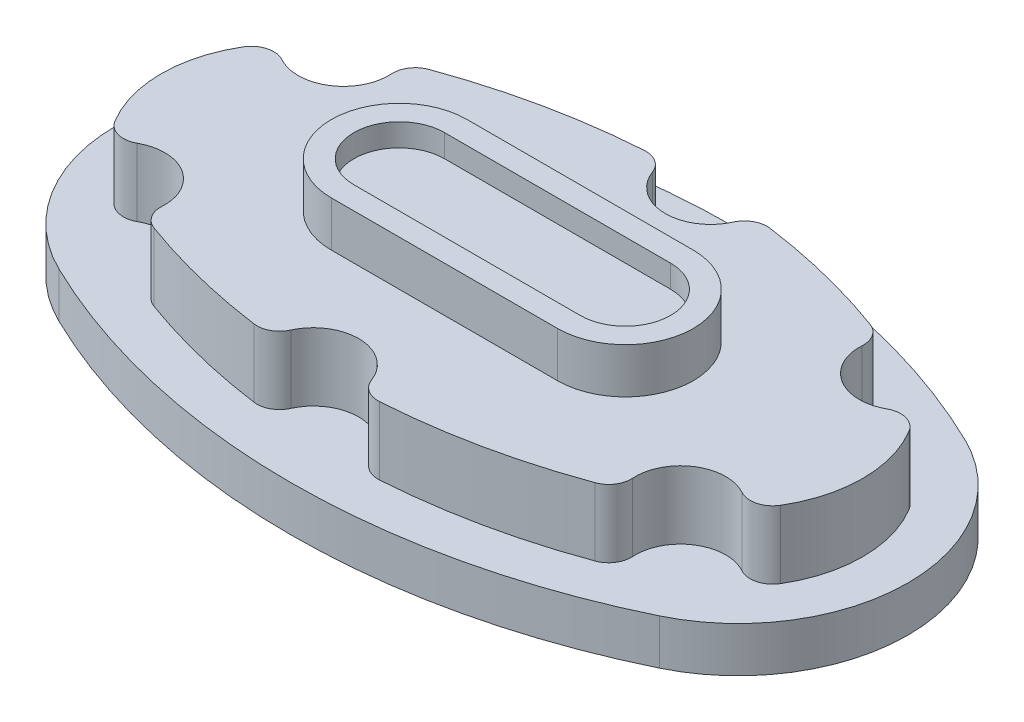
ISO-10303-21;
HEADER;
FILE_DESCRIPTION(('STEP AP214'),'2;1');
FILE_NAME('part.step','',(''),(''),'','','');
FILE_SCHEMA(('AUTOMOTIVE_DESIGN { 1 0 10303 214 1 1 1 1 }'));
ENDSEC;
DATA;
#1=APPLICATION_CONTEXT('core data for automotive mechanical design processes');
#2=APPLICATION_PROTOCOL_DEFINITION('international standard','automotive_design',2000,#1);
#3=PRODUCT_CONTEXT('',#1,'mechanical');
#4=PRODUCT('Part','Part','',(#3));
#5=PRODUCT_RELATED_PRODUCT_CATEGORY('part','',(#4));
#6=PRODUCT_DEFINITION_FORMATION('','',#4);
#7=PRODUCT_DEFINITION_CONTEXT('part definition',#1,'design');
#8=PRODUCT_DEFINITION('design','',#6,#7);
#9=PRODUCT_DEFINITION_SHAPE('','',#8);
#10=(LENGTH_UNIT() NAMED_UNIT(*) SI_UNIT(.MILLI.,.METRE.));
#11=(NAMED_UNIT(*) PLANE_ANGLE_UNIT() SI_UNIT($,.RADIAN.));
#12=(NAMED_UNIT(*) SI_UNIT($,.STERADIAN.) SOLID_ANGLE_UNIT());
#13=UNCERTAINTY_MEASURE_WITH_UNIT(LENGTH_MEASURE(1.E-05),#10,'distance_accuracy_value','');
#14=(GEOMETRIC_REPRESENTATION_CONTEXT(3) GLOBAL_UNCERTAINTY_ASSIGNED_CONTEXT((#13)) GLOBAL_UNIT_ASSIGNED_CONTEXT((#10,
#11,#12)) REPRESENTATION_CONTEXT('',''));
#15=CARTESIAN_POINT('',(0.,0.,0.));
#16=DIRECTION('',(0.,0.,1.));
#17=DIRECTION('',(1.,0.,0.));
#18=AXIS2_PLACEMENT_3D('',#15,#16,#17);
#19=CARTESIAN_POINT('',(49.8652090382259,-10.,103.094953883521));
#20=DIRECTION('',(0.,-1.,0.));
#21=DIRECTION('',(0.,0.,-1.));
#22=AXIS2_PLACEMENT_3D('',#19,#20,#21);
#23=PLANE('',#22);
#24=CARTESIAN_POINT('',(-0.134790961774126,-10.,206.189907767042));
#25=DIRECTION('',(0.,1.,0.));
#26=DIRECTION('',(0.,0.,-1.));
#27=AXIS2_PLACEMENT_3D('',#24,#25,#26);
#28=CIRCLE('',#27,304.15993992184);
#29=CARTESIAN_POINT('',(132.59344243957,-10.,-67.4823142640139));
#30=VERTEX_POINT('',#29);
#31=CARTESIAN_POINT('',(-132.863024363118,-10.,-67.4823142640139));
#32=VERTEX_POINT('',#31);
#33=EDGE_CURVE('E506',#30,#32,#28,.T.);
#34=ORIENTED_EDGE('',*,*,#33,.F.);
#35=CARTESIAN_POINT('',(99.8652090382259,-10.,0.));
#36=DIRECTION('',(0.,1.,0.));
#37=DIRECTION('',(0.,0.,1.));
#38=AXIS2_PLACEMENT_3D('',#35,#36,#37);
#39=CIRCLE('',#38,75.);
#40=CARTESIAN_POINT('',(132.59344243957,-10.,67.4823142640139));
#41=VERTEX_POINT('',#40);
#42=EDGE_CURVE('E517',#41,#30,#39,.T.);
#43=ORIENTED_EDGE('',*,*,#42,.F.);
#44=CARTESIAN_POINT('',(-0.134790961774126,-10.,-206.189907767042));
#45=DIRECTION('',(0.,1.,0.));
#46=DIRECTION('',(0.,0.,1.));
#47=AXIS2_PLACEMENT_3D('',#44,#45,#46);
#48=CIRCLE('',#47,304.15993992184);
#49=CARTESIAN_POINT('',(-132.863024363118,-10.,67.4823142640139));
#50=VERTEX_POINT('',#49);
#51=EDGE_CURVE('E514',#50,#41,#48,.T.);
#52=ORIENTED_EDGE('',*,*,#51,.F.);
#53=CARTESIAN_POINT('',(-100.134790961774,-10.,0.));
#54=DIRECTION('',(0.,1.,0.));
#55=DIRECTION('',(0.,0.,1.));
#56=AXIS2_PLACEMENT_3D('',#53,#54,#55);
#57=CIRCLE('',#56,75.);
#58=EDGE_CURVE('E511',#32,#50,#57,.T.);
#59=ORIENTED_EDGE('',*,*,#58,.F.);
#60=EDGE_LOOP('',(#34,#43,#52,#59));
#61=FACE_BOUND('',#60,.T.);
#62=CARTESIAN_POINT('',(99.8652090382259,-10.,0.));
#63=DIRECTION('',(0.,-1.,0.));
#64=DIRECTION('',(0.,0.,-1.));
#65=AXIS2_PLACEMENT_3D('',#62,#63,#64);
#66=CIRCLE('',#65,50.);
#67=CARTESIAN_POINT('',(145.28094245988,-10.,-20.9143768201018));
#68=VERTEX_POINT('',#67);
#69=CARTESIAN_POINT('',(145.28094245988,-10.,20.9143768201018));
#70=VERTEX_POINT('',#69);
#71=EDGE_CURVE('E1657',#68,#70,#66,.T.);
#72=ORIENTED_EDGE('',*,*,#71,.F.);
#73=CARTESIAN_POINT('',(136.19779577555,-10.,-16.7315014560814));
#74=DIRECTION('',(0.,-1.,0.));
#75=DIRECTION('',(0.,0.,-1.));
#76=AXIS2_PLACEMENT_3D('',#73,#74,#75);
#77=CIRCLE('',#76,10.);
#78=CARTESIAN_POINT('',(132.674400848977,-10.,-26.0902240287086));
#79=VERTEX_POINT('',#78);
#80=EDGE_CURVE('E717',#68,#79,#77,.F.);
#81=ORIENTED_EDGE('',*,*,#80,.T.);
#82=CARTESIAN_POINT('',(123.865913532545,-10.,-49.4870304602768));
#83=DIRECTION('',(0.,1.,0.));
#84=DIRECTION('',(0.,0.,-1.));
#85=AXIS2_PLACEMENT_3D('',#82,#83,#84);
#86=CIRCLE('',#85,25.0000000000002);
#87=CARTESIAN_POINT('',(98.8944339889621,-10.,-48.2932091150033));
#88=VERTEX_POINT('',#87);
#89=EDGE_CURVE('E446',#88,#79,#86,.T.);
#90=ORIENTED_EDGE('',*,*,#89,.F.);
#91=CARTESIAN_POINT('',(88.905842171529,-10.,-47.8156805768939));
#92=DIRECTION('',(0.,-1.,0.));
#93=DIRECTION('',(0.,0.,-1.));
#94=AXIS2_PLACEMENT_3D('',#91,#92,#93);
#95=CIRCLE('',#94,10.);
#96=CARTESIAN_POINT('',(92.213935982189,-10.,-57.2526565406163));
#97=VERTEX_POINT('',#96);
#98=EDGE_CURVE('E715',#88,#97,#95,.F.);
#99=ORIENTED_EDGE('',*,*,#98,.T.);
#100=CARTESIAN_POINT('',(-0.134790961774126,-10.,206.189907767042));
#101=DIRECTION('',(0.,-1.,0.));
#102=DIRECTION('',(0.,0.,-1.));
#103=AXIS2_PLACEMENT_3D('',#100,#101,#102);
#104=CIRCLE('',#103,279.15993992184);
#105=CARTESIAN_POINT('',(41.4733421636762,-10.,-69.8518197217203));
#106=VERTEX_POINT('',#105);
#107=EDGE_CURVE('E1684',#106,#97,#104,.T.);
#108=ORIENTED_EDGE('',*,*,#107,.F.);
#109=CARTESIAN_POINT('',(39.9828656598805,-10.,-59.9635195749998));
#110=DIRECTION('',(0.,-1.,0.));
#111=DIRECTION('',(0.,0.,-1.));
#112=AXIS2_PLACEMENT_3D('',#109,#110,#111);
#113=CIRCLE('',#112,10.);
#114=CARTESIAN_POINT('',(31.3778209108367,-10.,-65.0579483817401));
#115=VERTEX_POINT('',#114);
#116=EDGE_CURVE('E713',#106,#115,#113,.F.);
#117=ORIENTED_EDGE('',*,*,#116,.T.);
#118=CARTESIAN_POINT('',(9.8652090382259,-10.,-77.7940203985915));
#119=DIRECTION('',(0.,1.,0.));
#120=DIRECTION('',(0.,0.,-1.));
#121=AXIS2_PLACEMENT_3D('',#118,#119,#120);
#122=CIRCLE('',#121,25.0000000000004);
#123=CARTESIAN_POINT('',(-12.4899651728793,-10.,-66.6026761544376));
#124=VERTEX_POINT('',#123);
#125=EDGE_CURVE('E1682',#124,#115,#122,.T.);
#126=ORIENTED_EDGE('',*,*,#125,.F.);
#127=CARTESIAN_POINT('',(-21.4320348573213,-10.,-62.1261384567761));
#128=DIRECTION('',(0.,-1.,0.));
#129=DIRECTION('',(0.,0.,-1.));
#130=AXIS2_PLACEMENT_3D('',#127,#128,#129);
#131=CIRCLE('',#130,10.);
#132=CARTESIAN_POINT('',(-22.2232835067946,-10.,-72.0947855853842));
#133=VERTEX_POINT('',#132);
#134=EDGE_CURVE('E711',#124,#133,#131,.F.);
#135=ORIENTED_EDGE('',*,*,#134,.T.);
#136=CARTESIAN_POINT('',(-0.134790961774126,-10.,206.189907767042));
#137=DIRECTION('',(0.,-1.,0.));
#138=DIRECTION('',(0.,0.,-1.));
#139=AXIS2_PLACEMENT_3D('',#136,#137,#138);
#140=CIRCLE('',#139,279.15993992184);
#141=CARTESIAN_POINT('',(-92.4835179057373,-10.,-57.2526565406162));
#142=VERTEX_POINT('',#141);
#143=EDGE_CURVE('E1679',#142,#133,#140,.T.);
#144=ORIENTED_EDGE('',*,*,#143,.F.);
#145=CARTESIAN_POINT('',(-89.1754240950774,-10.,-47.8156805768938));
#146=DIRECTION('',(0.,-1.,0.));
#147=DIRECTION('',(0.,0.,-1.));
#148=AXIS2_PLACEMENT_3D('',#145,#146,#147);
#149=CIRCLE('',#148,10.);
#150=CARTESIAN_POINT('',(-99.1640159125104,-10.,-48.2932091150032));
#151=VERTEX_POINT('',#150);
#152=EDGE_CURVE('E709',#142,#151,#149,.F.);
#153=ORIENTED_EDGE('',*,*,#152,.T.);
#154=CARTESIAN_POINT('',(-124.135495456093,-10.,-49.4870304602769));
#155=DIRECTION('',(0.,1.,0.));
#156=DIRECTION('',(0.,0.,-1.));
#157=AXIS2_PLACEMENT_3D('',#154,#155,#156);
#158=CIRCLE('',#157,25.0000000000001);
#159=CARTESIAN_POINT('',(-132.943982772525,-10.,-26.0902240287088));
#160=VERTEX_POINT('',#159);
#161=EDGE_CURVE('E1676',#160,#151,#158,.T.);
#162=ORIENTED_EDGE('',*,*,#161,.F.);
#163=CARTESIAN_POINT('',(-136.467377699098,-10.,-16.7315014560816));
#164=DIRECTION('',(0.,-1.,0.));
#165=DIRECTION('',(0.,0.,-1.));
#166=AXIS2_PLACEMENT_3D('',#163,#164,#165);
#167=CIRCLE('',#166,10.);
#168=CARTESIAN_POINT('',(-145.550524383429,-10.,-20.914376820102));
#169=VERTEX_POINT('',#168);
#170=EDGE_CURVE('E707',#160,#169,#167,.F.);
#171=ORIENTED_EDGE('',*,*,#170,.T.);
#172=CARTESIAN_POINT('',(-100.134790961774,-10.,0.));
#173=DIRECTION('',(0.,-1.,0.));
#174=DIRECTION('',(0.,0.,-1.));
#175=AXIS2_PLACEMENT_3D('',#172,#173,#174);
#176=CIRCLE('',#175,50.);
#177=CARTESIAN_POINT('',(-145.550524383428,-10.,20.9143768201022));
#178=VERTEX_POINT('',#177);
#179=EDGE_CURVE('E1673',#178,#169,#176,.T.);
#180=ORIENTED_EDGE('',*,*,#179,.F.);
#181=CARTESIAN_POINT('',(-136.467377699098,-10.,16.7315014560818));
#182=DIRECTION('',(0.,-1.,0.));
#183=DIRECTION('',(0.,0.,-1.));
#184=AXIS2_PLACEMENT_3D('',#181,#182,#183);
#185=CIRCLE('',#184,10.);
#186=CARTESIAN_POINT('',(-132.943982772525,-10.,26.090224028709));
#187=VERTEX_POINT('',#186);
#188=EDGE_CURVE('E705',#178,#187,#185,.F.);
#189=ORIENTED_EDGE('',*,*,#188,.T.);
#190=CARTESIAN_POINT('',(-124.135495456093,-10.,49.4870304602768));
#191=DIRECTION('',(0.,1.,0.));
#192=DIRECTION('',(0.,0.,-1.));
#193=AXIS2_PLACEMENT_3D('',#190,#191,#192);
#194=CIRCLE('',#193,24.9999999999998);
#195=CARTESIAN_POINT('',(-99.1640159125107,-10.,48.2932091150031));
#196=VERTEX_POINT('',#195);
#197=EDGE_CURVE('E1670',#196,#187,#194,.T.);
#198=ORIENTED_EDGE('',*,*,#197,.F.);
#199=CARTESIAN_POINT('',(-89.1754240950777,-10.,47.8156805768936));
#200=DIRECTION('',(0.,-1.,0.));
#201=DIRECTION('',(0.,0.,-1.));
#202=AXIS2_PLACEMENT_3D('',#199,#200,#201);
#203=CIRCLE('',#202,10.);
#204=CARTESIAN_POINT('',(-92.4835179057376,-10.,57.252656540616));
#205=VERTEX_POINT('',#204);
#206=EDGE_CURVE('E703',#196,#205,#203,.F.);
#207=ORIENTED_EDGE('',*,*,#206,.T.);
#208=CARTESIAN_POINT('',(-0.134790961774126,-10.,-206.189907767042));
#209=DIRECTION('',(0.,-1.,0.));
#210=DIRECTION('',(0.,0.,-1.));
#211=AXIS2_PLACEMENT_3D('',#208,#209,#210);
#212=CIRCLE('',#211,279.15993992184);
#213=CARTESIAN_POINT('',(-41.7429240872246,-10.,69.8518197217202));
#214=VERTEX_POINT('',#213);
#215=EDGE_CURVE('E1667',#214,#205,#212,.T.);
#216=ORIENTED_EDGE('',*,*,#215,.F.);
#217=CARTESIAN_POINT('',(-40.252447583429,-10.,59.9635195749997));
#218=DIRECTION('',(0.,-1.,0.));
#219=DIRECTION('',(0.,0.,-1.));
#220=AXIS2_PLACEMENT_3D('',#217,#218,#219);
#221=CIRCLE('',#220,10.);
#222=CARTESIAN_POINT('',(-31.6474028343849,-10.,65.0579483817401));
#223=VERTEX_POINT('',#222);
#224=EDGE_CURVE('E701',#214,#223,#221,.F.);
#225=ORIENTED_EDGE('',*,*,#224,.T.);
#226=CARTESIAN_POINT('',(-10.1347909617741,-10.,77.7940203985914));
#227=DIRECTION('',(0.,1.,0.));
#228=DIRECTION('',(0.,0.,-1.));
#229=AXIS2_PLACEMENT_3D('',#226,#227,#228);
#230=CIRCLE('',#229,25.0000000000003);
#231=CARTESIAN_POINT('',(12.220383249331,-10.,66.6026761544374));
#232=VERTEX_POINT('',#231);
#233=EDGE_CURVE('E1660',#232,#223,#230,.T.);
#234=ORIENTED_EDGE('',*,*,#233,.F.);
#235=CARTESIAN_POINT('',(21.1624529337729,-10.,62.1261384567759));
#236=DIRECTION('',(0.,-1.,0.));
#237=DIRECTION('',(0.,0.,-1.));
#238=AXIS2_PLACEMENT_3D('',#235,#236,#237);
#239=CIRCLE('',#238,10.);
#240=CARTESIAN_POINT('',(21.9537015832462,-10.,72.0947855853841));
#241=VERTEX_POINT('',#240);
#242=EDGE_CURVE('E699',#232,#241,#239,.F.);
#243=ORIENTED_EDGE('',*,*,#242,.T.);
#244=CARTESIAN_POINT('',(-0.134790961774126,-10.,-206.189907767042));
#245=DIRECTION('',(0.,-1.,0.));
#246=DIRECTION('',(0.,0.,-1.));
#247=AXIS2_PLACEMENT_3D('',#244,#245,#246);
#248=CIRCLE('',#247,279.15993992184);
#249=CARTESIAN_POINT('',(92.2139359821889,-10.,57.2526565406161));
#250=VERTEX_POINT('',#249);
#251=EDGE_CURVE('E1656',#250,#241,#248,.T.);
#252=ORIENTED_EDGE('',*,*,#251,.F.);
#253=CARTESIAN_POINT('',(88.905842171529,-10.,47.8156805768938));
#254=DIRECTION('',(0.,-1.,0.));
#255=DIRECTION('',(0.,0.,-1.));
#256=AXIS2_PLACEMENT_3D('',#253,#254,#255);
#257=CIRCLE('',#256,10.);
#258=CARTESIAN_POINT('',(98.8944339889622,-10.,48.2932091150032));
#259=VERTEX_POINT('',#258);
#260=EDGE_CURVE('E697',#250,#259,#257,.F.);
#261=ORIENTED_EDGE('',*,*,#260,.T.);
#262=CARTESIAN_POINT('',(123.865913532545,-10.,49.4870304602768));
#263=DIRECTION('',(0.,1.,0.));
#264=DIRECTION('',(0.,0.,-1.));
#265=AXIS2_PLACEMENT_3D('',#262,#263,#264);
#266=CIRCLE('',#265,25.0000000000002);
#267=CARTESIAN_POINT('',(132.674400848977,-10.,26.0902240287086));
#268=VERTEX_POINT('',#267);
#269=EDGE_CURVE('E1651',#268,#259,#266,.T.);
#270=ORIENTED_EDGE('',*,*,#269,.F.);
#271=CARTESIAN_POINT('',(136.19779577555,-10.,16.7315014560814));
#272=DIRECTION('',(0.,-1.,0.));
#273=DIRECTION('',(0.,0.,-1.));
#274=AXIS2_PLACEMENT_3D('',#271,#272,#273);
#275=CIRCLE('',#274,10.);
#276=EDGE_CURVE('E695',#268,#70,#275,.F.);
#277=ORIENTED_EDGE('',*,*,#276,.T.);
#278=EDGE_LOOP('',(#72,#81,#90,#99,#108,#117,#126,#135,#144,#153,#162,#171,#180,#189,#198,#207,
#216,#225,#234,#243,#252,#261,#270,#277));
#279=FACE_BOUND('',#278,.T.);
#280=ADVANCED_FACE('F39',(#61,#279),#23,.T.);
#281=CARTESIAN_POINT('',(-0.134790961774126,-10.,206.189907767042));
#282=DIRECTION('',(0.,1.,0.));
#283=DIRECTION('',(0.,0.,1.));
#284=AXIS2_PLACEMENT_3D('',#281,#282,#283);
#285=CYLINDRICAL_SURFACE('',#284,304.15993992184);
#286=DIRECTION('',(0.,1.,0.));
#287=VECTOR('',#286,1.);
#288=CARTESIAN_POINT('',(-132.863024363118,-10.,-67.4823142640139));
#289=LINE('',#288,#287);
#290=CARTESIAN_POINT('',(-132.863024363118,10.,-67.4823142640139));
#291=VERTEX_POINT('',#290);
#292=EDGE_CURVE('E520',#32,#291,#289,.T.);
#293=ORIENTED_EDGE('',*,*,#292,.T.);
#294=CARTESIAN_POINT('',(-0.134790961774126,10.,206.189907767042));
#295=DIRECTION('',(0.,1.,0.));
#296=DIRECTION('',(0.,0.,-1.));
#297=AXIS2_PLACEMENT_3D('',#294,#295,#296);
#298=CIRCLE('',#297,304.15993992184);
#299=CARTESIAN_POINT('',(132.59344243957,10.,-67.4823142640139));
#300=VERTEX_POINT('',#299);
#301=EDGE_CURVE('E485',#300,#291,#298,.T.);
#302=ORIENTED_EDGE('',*,*,#301,.F.);
#303=DIRECTION('',(0.,1.,0.));
#304=VECTOR('',#303,1.);
#305=CARTESIAN_POINT('',(132.59344243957,-10.,-67.4823142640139));
#306=LINE('',#305,#304);
#307=EDGE_CURVE('E521',#30,#300,#306,.T.);
#308=ORIENTED_EDGE('',*,*,#307,.F.);
#309=ORIENTED_EDGE('',*,*,#33,.T.);
#310=EDGE_LOOP('',(#293,#302,#308,#309));
#311=FACE_BOUND('',#310,.T.);
#312=ADVANCED_FACE('F852',(#311),#285,.T.);
#313=CARTESIAN_POINT('',(99.8652090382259,-10.,0.));
#314=DIRECTION('',(0.,1.,0.));
#315=DIRECTION('',(0.,0.,1.));
#316=AXIS2_PLACEMENT_3D('',#313,#314,#315);
#317=CYLINDRICAL_SURFACE('',#316,75.);
#318=ORIENTED_EDGE('',*,*,#307,.T.);
#319=CARTESIAN_POINT('',(99.8652090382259,10.,0.));
#320=DIRECTION('',(0.,1.,0.));
#321=DIRECTION('',(0.,0.,1.));
#322=AXIS2_PLACEMENT_3D('',#319,#320,#321);
#323=CIRCLE('',#322,75.);
#324=CARTESIAN_POINT('',(132.59344243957,10.,67.4823142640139));
#325=VERTEX_POINT('',#324);
#326=EDGE_CURVE('E503',#325,#300,#323,.T.);
#327=ORIENTED_EDGE('',*,*,#326,.F.);
#328=DIRECTION('',(0.,1.,0.));
#329=VECTOR('',#328,1.);
#330=CARTESIAN_POINT('',(132.59344243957,-10.,67.4823142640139));
#331=LINE('',#330,#329);
#332=EDGE_CURVE('E524',#41,#325,#331,.T.);
#333=ORIENTED_EDGE('',*,*,#332,.F.);
#334=ORIENTED_EDGE('',*,*,#42,.T.);
#335=EDGE_LOOP('',(#318,#327,#333,#334));
#336=FACE_BOUND('',#335,.T.);
#337=ADVANCED_FACE('F858',(#336),#317,.T.);
#338=CARTESIAN_POINT('',(-0.134790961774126,-10.,-206.189907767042));
#339=DIRECTION('',(0.,1.,0.));
#340=DIRECTION('',(0.,0.,1.));
#341=AXIS2_PLACEMENT_3D('',#338,#339,#340);
#342=CYLINDRICAL_SURFACE('',#341,304.15993992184);
#343=ORIENTED_EDGE('',*,*,#332,.T.);
#344=CARTESIAN_POINT('',(-0.134790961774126,10.,-206.189907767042));
#345=DIRECTION('',(0.,1.,0.));
#346=DIRECTION('',(0.,0.,1.));
#347=AXIS2_PLACEMENT_3D('',#344,#345,#346);
#348=CIRCLE('',#347,304.15993992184);
#349=CARTESIAN_POINT('',(-132.863024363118,10.,67.4823142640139));
#350=VERTEX_POINT('',#349);
#351=EDGE_CURVE('E499',#350,#325,#348,.T.);
#352=ORIENTED_EDGE('',*,*,#351,.F.);
#353=DIRECTION('',(0.,1.,0.));
#354=VECTOR('',#353,1.);
#355=CARTESIAN_POINT('',(-132.863024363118,-10.,67.4823142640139));
#356=LINE('',#355,#354);
#357=EDGE_CURVE('E526',#50,#350,#356,.T.);
#358=ORIENTED_EDGE('',*,*,#357,.F.);
#359=ORIENTED_EDGE('',*,*,#51,.T.);
#360=EDGE_LOOP('',(#343,#352,#358,#359));
#361=FACE_BOUND('',#360,.T.);
#362=ADVANCED_FACE('F868',(#361),#342,.T.);
#363=CARTESIAN_POINT('',(-100.134790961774,-10.,0.));
#364=DIRECTION('',(0.,1.,0.));
#365=DIRECTION('',(0.,0.,1.));
#366=AXIS2_PLACEMENT_3D('',#363,#364,#365);
#367=CYLINDRICAL_SURFACE('',#366,75.);
#368=ORIENTED_EDGE('',*,*,#357,.T.);
#369=CARTESIAN_POINT('',(-100.134790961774,10.,0.));
#370=DIRECTION('',(0.,1.,0.));
#371=DIRECTION('',(0.,0.,1.));
#372=AXIS2_PLACEMENT_3D('',#369,#370,#371);
#373=CIRCLE('',#372,75.);
#374=EDGE_CURVE('E491',#291,#350,#373,.T.);
#375=ORIENTED_EDGE('',*,*,#374,.F.);
#376=ORIENTED_EDGE('',*,*,#292,.F.);
#377=ORIENTED_EDGE('',*,*,#58,.T.);
#378=EDGE_LOOP('',(#368,#375,#376,#377));
#379=FACE_BOUND('',#378,.T.);
#380=ADVANCED_FACE('F872',(#379),#367,.T.);
#381=CARTESIAN_POINT('',(49.8652090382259,10.,103.094953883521));
#382=DIRECTION('',(0.,-1.,0.));
#383=DIRECTION('',(0.,0.,-1.));
#384=AXIS2_PLACEMENT_3D('',#381,#382,#383);
#385=PLANE('',#384);
#386=CARTESIAN_POINT('',(9.8652090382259,10.,-77.7940203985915));
#387=DIRECTION('',(0.,-1.,0.));
#388=DIRECTION('',(0.,0.,1.));
#389=AXIS2_PLACEMENT_3D('',#386,#387,#388);
#390=CIRCLE('',#389,20.0000000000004);
#391=CARTESIAN_POINT('',(28.0837482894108,10.,-69.5426673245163));
#392=VERTEX_POINT('',#391);
#393=CARTESIAN_POINT('',(-8.88859956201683,10.,-70.8445842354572));
#394=VERTEX_POINT('',#393);
#395=EDGE_CURVE('E787',#392,#394,#390,.T.);
#396=ORIENTED_EDGE('',*,*,#395,.F.);
#397=CARTESIAN_POINT('',(37.1930179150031,10.,-65.4169907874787));
#398=DIRECTION('',(0.,-1.,0.));
#399=DIRECTION('',(0.,0.,-1.));
#400=AXIS2_PLACEMENT_3D('',#397,#398,#399);
#401=CIRCLE('',#400,10.);
#402=CARTESIAN_POINT('',(38.5545519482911,10.,-75.3238684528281));
#403=VERTEX_POINT('',#402);
#404=EDGE_CURVE('E725',#392,#403,#401,.T.);
#405=ORIENTED_EDGE('',*,*,#404,.T.);
#406=CARTESIAN_POINT('',(-0.134790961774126,10.,206.189907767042));
#407=DIRECTION('',(0.,1.,0.));
#408=DIRECTION('',(0.,0.,1.));
#409=AXIS2_PLACEMENT_3D('',#406,#407,#408);
#410=CIRCLE('',#409,284.15993992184);
#411=CARTESIAN_POINT('',(97.3533702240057,10.,-60.7238046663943));
#412=VERTEX_POINT('',#411);
#413=EDGE_CURVE('E493',#412,#403,#410,.T.);
#414=ORIENTED_EDGE('',*,*,#413,.F.);
#415=CARTESIAN_POINT('',(93.9226205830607,10.,-51.3307243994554));
#416=DIRECTION('',(0.,-1.,0.));
#417=DIRECTION('',(0.,0.,-1.));
#418=AXIS2_PLACEMENT_3D('',#415,#416,#417);
#419=CIRCLE('',#418,10.);
#420=CARTESIAN_POINT('',(103.903718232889,10.,-50.7161597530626));
#421=VERTEX_POINT('',#420);
#422=EDGE_CURVE('E727',#412,#421,#419,.T.);
#423=ORIENTED_EDGE('',*,*,#422,.T.);
#424=CARTESIAN_POINT('',(123.865913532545,10.,-49.4870304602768));
#425=DIRECTION('',(0.,-1.,0.));
#426=DIRECTION('',(0.,0.,1.));
#427=AXIS2_PLACEMENT_3D('',#424,#425,#426);
#428=CIRCLE('',#427,20.0000000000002);
#429=CARTESIAN_POINT('',(133.55428483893,10.,-31.9903032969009));
#430=VERTEX_POINT('',#429);
#431=EDGE_CURVE('E811',#430,#421,#428,.T.);
#432=ORIENTED_EDGE('',*,*,#431,.F.);
#433=CARTESIAN_POINT('',(138.398470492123,10.,-23.2419397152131));
#434=DIRECTION('',(0.,-1.,0.));
#435=DIRECTION('',(0.,0.,-1.));
#436=AXIS2_PLACEMENT_3D('',#433,#434,#435);
#437=CIRCLE('',#436,10.);
#438=CARTESIAN_POINT('',(146.961417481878,10.,-28.4068152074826));
#439=VERTEX_POINT('',#438);
#440=EDGE_CURVE('E729',#430,#439,#437,.T.);
#441=ORIENTED_EDGE('',*,*,#440,.T.);
#442=CARTESIAN_POINT('',(99.8652090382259,10.,0.));
#443=DIRECTION('',(0.,1.,0.));
#444=DIRECTION('',(0.,0.,1.));
#445=AXIS2_PLACEMENT_3D('',#442,#443,#444);
#446=CIRCLE('',#445,55.);
#447=CARTESIAN_POINT('',(146.961417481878,10.,28.4068152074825));
#448=VERTEX_POINT('',#447);
#449=EDGE_CURVE('E809',#448,#439,#446,.T.);
#450=ORIENTED_EDGE('',*,*,#449,.F.);
#451=CARTESIAN_POINT('',(138.398470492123,10.,23.2419397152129));
#452=DIRECTION('',(0.,-1.,0.));
#453=DIRECTION('',(0.,0.,-1.));
#454=AXIS2_PLACEMENT_3D('',#451,#452,#453);
#455=CIRCLE('',#454,10.);
#456=CARTESIAN_POINT('',(133.554284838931,10.,31.9903032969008));
#457=VERTEX_POINT('',#456);
#458=EDGE_CURVE('E731',#448,#457,#455,.T.);
#459=ORIENTED_EDGE('',*,*,#458,.T.);
#460=CARTESIAN_POINT('',(123.865913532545,10.,49.4870304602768));
#461=DIRECTION('',(0.,-1.,0.));
#462=DIRECTION('',(0.,0.,1.));
#463=AXIS2_PLACEMENT_3D('',#460,#461,#462);
#464=CIRCLE('',#463,20.0000000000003);
#465=CARTESIAN_POINT('',(103.903718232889,10.,50.7161597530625));
#466=VERTEX_POINT('',#465);
#467=EDGE_CURVE('E806',#466,#457,#464,.T.);
#468=ORIENTED_EDGE('',*,*,#467,.F.);
#469=CARTESIAN_POINT('',(93.9226205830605,10.,51.3307243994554));
#470=DIRECTION('',(0.,-1.,0.));
#471=DIRECTION('',(0.,0.,-1.));
#472=AXIS2_PLACEMENT_3D('',#469,#470,#471);
#473=CIRCLE('',#472,10.);
#474=CARTESIAN_POINT('',(97.3533702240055,10.,60.7238046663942));
#475=VERTEX_POINT('',#474);
#476=EDGE_CURVE('E733',#466,#475,#473,.T.);
#477=ORIENTED_EDGE('',*,*,#476,.T.);
#478=CARTESIAN_POINT('',(-0.134790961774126,10.,-206.189907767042));
#479=DIRECTION('',(0.,1.,0.));
#480=DIRECTION('',(0.,0.,1.));
#481=AXIS2_PLACEMENT_3D('',#478,#479,#480);
#482=CIRCLE('',#481,284.15993992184);
#483=CARTESIAN_POINT('',(18.6572407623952,10.,77.3479750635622));
#484=VERTEX_POINT('',#483);
#485=EDGE_CURVE('E803',#484,#475,#482,.T.);
#486=ORIENTED_EDGE('',*,*,#485,.F.);
#487=CARTESIAN_POINT('',(17.9959219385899,10.,67.36986615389));
#488=DIRECTION('',(0.,-1.,0.));
#489=DIRECTION('',(0.,0.,-1.));
#490=AXIS2_PLACEMENT_3D('',#487,#488,#489);
#491=CIRCLE('',#490,10.);
#492=CARTESIAN_POINT('',(8.61901763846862,10.,70.8445842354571));
#493=VERTEX_POINT('',#492);
#494=EDGE_CURVE('E735',#484,#493,#491,.T.);
#495=ORIENTED_EDGE('',*,*,#494,.T.);
#496=CARTESIAN_POINT('',(-10.1347909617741,10.,77.7940203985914));
#497=DIRECTION('',(0.,-1.,0.));
#498=DIRECTION('',(0.,0.,1.));
#499=AXIS2_PLACEMENT_3D('',#496,#497,#498);
#500=CIRCLE('',#499,20.0000000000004);
#501=CARTESIAN_POINT('',(-28.353330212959,10.,69.5426673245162));
#502=VERTEX_POINT('',#501);
#503=EDGE_CURVE('E745',#502,#493,#500,.T.);
#504=ORIENTED_EDGE('',*,*,#503,.F.);
#505=CARTESIAN_POINT('',(-37.4625998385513,10.,65.4169907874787));
#506=DIRECTION('',(0.,-1.,0.));
#507=DIRECTION('',(0.,0.,-1.));
#508=AXIS2_PLACEMENT_3D('',#505,#506,#507);
#509=CIRCLE('',#508,10.);
#510=CARTESIAN_POINT('',(-38.8241338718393,10.,75.323868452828));
#511=VERTEX_POINT('',#510);
#512=EDGE_CURVE('E737',#502,#511,#509,.T.);
#513=ORIENTED_EDGE('',*,*,#512,.T.);
#514=CARTESIAN_POINT('',(-0.134790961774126,10.,-206.189907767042));
#515=DIRECTION('',(0.,1.,0.));
#516=DIRECTION('',(0.,0.,1.));
#517=AXIS2_PLACEMENT_3D('',#514,#515,#516);
#518=CIRCLE('',#517,284.15993992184);
#519=CARTESIAN_POINT('',(-97.6229521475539,10.,60.7238046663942));
#520=VERTEX_POINT('',#519);
#521=EDGE_CURVE('E743',#520,#511,#518,.T.);
#522=ORIENTED_EDGE('',*,*,#521,.F.);
#523=CARTESIAN_POINT('',(-94.1922025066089,10.,51.3307243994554));
#524=DIRECTION('',(0.,-1.,0.));
#525=DIRECTION('',(0.,0.,-1.));
#526=AXIS2_PLACEMENT_3D('',#523,#524,#525);
#527=CIRCLE('',#526,10.);
#528=CARTESIAN_POINT('',(-104.173300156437,10.,50.7161597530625));
#529=VERTEX_POINT('',#528);
#530=EDGE_CURVE('E47',#520,#529,#527,.T.);
#531=ORIENTED_EDGE('',*,*,#530,.T.);
#532=CARTESIAN_POINT('',(-124.135495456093,10.,49.4870304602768));
#533=DIRECTION('',(0.,-1.,0.));
#534=DIRECTION('',(0.,0.,1.));
#535=AXIS2_PLACEMENT_3D('',#532,#533,#534);
#536=CIRCLE('',#535,19.9999999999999);
#537=CARTESIAN_POINT('',(-133.823866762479,10.,31.9903032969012));
#538=VERTEX_POINT('',#537);
#539=EDGE_CURVE('E754',#538,#529,#536,.T.);
#540=ORIENTED_EDGE('',*,*,#539,.F.);
#541=CARTESIAN_POINT('',(-138.668052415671,10.,23.2419397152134));
#542=DIRECTION('',(0.,-1.,0.));
#543=DIRECTION('',(0.,0.,-1.));
#544=AXIS2_PLACEMENT_3D('',#541,#542,#543);
#545=CIRCLE('',#544,10.);
#546=CARTESIAN_POINT('',(-147.230999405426,10.,28.406815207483));
#547=VERTEX_POINT('',#546);
#548=EDGE_CURVE('E12',#538,#547,#545,.T.);
#549=ORIENTED_EDGE('',*,*,#548,.T.);
#550=CARTESIAN_POINT('',(-100.134790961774,10.,0.));
#551=DIRECTION('',(0.,1.,0.));
#552=DIRECTION('',(0.,0.,1.));
#553=AXIS2_PLACEMENT_3D('',#550,#551,#552);
#554=CIRCLE('',#553,55.);
#555=CARTESIAN_POINT('',(-147.230999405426,10.,-28.4068152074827));
#556=VERTEX_POINT('',#555);
#557=EDGE_CURVE('E798',#556,#547,#554,.T.);
#558=ORIENTED_EDGE('',*,*,#557,.F.);
#559=CARTESIAN_POINT('',(-138.668052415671,10.,-23.2419397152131));
#560=DIRECTION('',(0.,-1.,0.));
#561=DIRECTION('',(0.,0.,-1.));
#562=AXIS2_PLACEMENT_3D('',#559,#560,#561);
#563=CIRCLE('',#562,10.);
#564=CARTESIAN_POINT('',(-133.823866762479,10.,-31.990303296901));
#565=VERTEX_POINT('',#564);
#566=EDGE_CURVE('E719',#556,#565,#563,.T.);
#567=ORIENTED_EDGE('',*,*,#566,.T.);
#568=CARTESIAN_POINT('',(-124.135495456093,10.,-49.4870304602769));
#569=DIRECTION('',(0.,-1.,0.));
#570=DIRECTION('',(0.,0.,1.));
#571=AXIS2_PLACEMENT_3D('',#568,#569,#570);
#572=CIRCLE('',#571,20.0000000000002);
#573=CARTESIAN_POINT('',(-104.173300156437,10.,-50.7161597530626));
#574=VERTEX_POINT('',#573);
#575=EDGE_CURVE('E795',#574,#565,#572,.T.);
#576=ORIENTED_EDGE('',*,*,#575,.F.);
#577=CARTESIAN_POINT('',(-94.1922025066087,10.,-51.3307243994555));
#578=DIRECTION('',(0.,-1.,0.));
#579=DIRECTION('',(0.,0.,-1.));
#580=AXIS2_PLACEMENT_3D('',#577,#578,#579);
#581=CIRCLE('',#580,10.);
#582=CARTESIAN_POINT('',(-97.6229521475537,10.,-60.7238046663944));
#583=VERTEX_POINT('',#582);
#584=EDGE_CURVE('E721',#574,#583,#581,.T.);
#585=ORIENTED_EDGE('',*,*,#584,.T.);
#586=CARTESIAN_POINT('',(-0.134790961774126,10.,206.189907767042));
#587=DIRECTION('',(0.,1.,0.));
#588=DIRECTION('',(0.,0.,1.));
#589=AXIS2_PLACEMENT_3D('',#586,#587,#588);
#590=CIRCLE('',#589,284.15993992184);
#591=CARTESIAN_POINT('',(-18.9268226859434,10.,-77.3479750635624));
#592=VERTEX_POINT('',#591);
#593=EDGE_CURVE('E791',#592,#583,#590,.T.);
#594=ORIENTED_EDGE('',*,*,#593,.F.);
#595=CARTESIAN_POINT('',(-18.2655038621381,10.,-67.3698661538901));
#596=DIRECTION('',(0.,-1.,0.));
#597=DIRECTION('',(0.,0.,-1.));
#598=AXIS2_PLACEMENT_3D('',#595,#596,#597);
#599=CIRCLE('',#598,10.);
#600=EDGE_CURVE('E723',#592,#394,#599,.T.);
#601=ORIENTED_EDGE('',*,*,#600,.T.);
#602=EDGE_LOOP('',(#396,#405,#414,#423,#432,#441,#450,#459,#468,#477,#486,#495,#504,#513,#522,
#531,#540,#549,#558,#567,#576,#585,#594,#601));
#603=FACE_BOUND('',#602,.T.);
#604=ORIENTED_EDGE('',*,*,#301,.T.);
#605=ORIENTED_EDGE('',*,*,#374,.T.);
#606=ORIENTED_EDGE('',*,*,#351,.T.);
#607=ORIENTED_EDGE('',*,*,#326,.T.);
#608=EDGE_LOOP('',(#604,#605,#606,#607));
#609=FACE_BOUND('',#608,.T.);
#610=ADVANCED_FACE('F741',(#603,#609),#385,.F.);
#611=CARTESIAN_POINT('',(9.8652090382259,40.,-77.7940203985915));
#612=DIRECTION('',(0.,-1.,0.));
#613=DIRECTION('',(0.,0.,-1.));
#614=AXIS2_PLACEMENT_3D('',#611,#612,#613);
#615=CYLINDRICAL_SURFACE('',#614,20.0000000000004);
#616=ORIENTED_EDGE('',*,*,#395,.T.);
#617=DIRECTION('',(0.,-1.,0.));
#618=VECTOR('',#617,1.);
#619=CARTESIAN_POINT('',(-8.88859956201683,40.,-70.8445842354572));
#620=LINE('',#619,#618);
#621=CARTESIAN_POINT('',(-8.88859956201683,40.,-70.8445842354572));
#622=VERTEX_POINT('',#621);
#623=EDGE_CURVE('E654',#394,#622,#620,.F.);
#624=ORIENTED_EDGE('',*,*,#623,.T.);
#625=CARTESIAN_POINT('',(9.8652090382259,40.,-77.7940203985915));
#626=DIRECTION('',(0.,-1.,0.));
#627=DIRECTION('',(0.,0.,1.));
#628=AXIS2_PLACEMENT_3D('',#625,#626,#627);
#629=CIRCLE('',#628,20.0000000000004);
#630=CARTESIAN_POINT('',(28.0837482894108,40.,-69.5426673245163));
#631=VERTEX_POINT('',#630);
#632=EDGE_CURVE('E817',#631,#622,#629,.T.);
#633=ORIENTED_EDGE('',*,*,#632,.F.);
#634=DIRECTION('',(0.,-1.,0.));
#635=VECTOR('',#634,1.);
#636=CARTESIAN_POINT('',(28.0837482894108,40.,-69.5426673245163));
#637=LINE('',#636,#635);
#638=EDGE_CURVE('E651',#631,#392,#637,.T.);
#639=ORIENTED_EDGE('',*,*,#638,.T.);
#640=EDGE_LOOP('',(#616,#624,#633,#639));
#641=FACE_BOUND('',#640,.T.);
#642=ADVANCED_FACE('F1316',(#641),#615,.F.);
#643=CARTESIAN_POINT('',(-0.134790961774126,40.,206.189907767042));
#644=DIRECTION('',(0.,-1.,0.));
#645=DIRECTION('',(0.,0.,-1.));
#646=AXIS2_PLACEMENT_3D('',#643,#644,#645);
#647=CYLINDRICAL_SURFACE('',#646,284.15993992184);
#648=ORIENTED_EDGE('',*,*,#593,.T.);
#649=DIRECTION('',(0.,-1.,0.));
#650=VECTOR('',#649,1.);
#651=CARTESIAN_POINT('',(-97.6229521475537,40.,-60.7238046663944));
#652=LINE('',#651,#650);
#653=CARTESIAN_POINT('',(-97.6229521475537,40.,-60.7238046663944));
#654=VERTEX_POINT('',#653);
#655=EDGE_CURVE('E649',#583,#654,#652,.F.);
#656=ORIENTED_EDGE('',*,*,#655,.T.);
#657=CARTESIAN_POINT('',(-0.134790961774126,40.,206.189907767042));
#658=DIRECTION('',(0.,1.,0.));
#659=DIRECTION('',(0.,0.,1.));
#660=AXIS2_PLACEMENT_3D('',#657,#658,#659);
#661=CIRCLE('',#660,284.15993992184);
#662=CARTESIAN_POINT('',(-18.9268226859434,40.,-77.3479750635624));
#663=VERTEX_POINT('',#662);
#664=EDGE_CURVE('E822',#663,#654,#661,.T.);
#665=ORIENTED_EDGE('',*,*,#664,.F.);
#666=DIRECTION('',(0.,-1.,0.));
#667=VECTOR('',#666,1.);
#668=CARTESIAN_POINT('',(-18.9268226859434,40.,-77.3479750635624));
#669=LINE('',#668,#667);
#670=EDGE_CURVE('E646',#663,#592,#669,.T.);
#671=ORIENTED_EDGE('',*,*,#670,.T.);
#672=EDGE_LOOP('',(#648,#656,#665,#671));
#673=FACE_BOUND('',#672,.T.);
#674=ADVANCED_FACE('F1310',(#673),#647,.T.);
#675=CARTESIAN_POINT('',(-124.135495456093,40.,-49.4870304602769));
#676=DIRECTION('',(0.,-1.,0.));
#677=DIRECTION('',(0.,0.,-1.));
#678=AXIS2_PLACEMENT_3D('',#675,#676,#677);
#679=CYLINDRICAL_SURFACE('',#678,20.0000000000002);
#680=ORIENTED_EDGE('',*,*,#575,.T.);
#681=DIRECTION('',(0.,-1.,0.));
#682=VECTOR('',#681,1.);
#683=CARTESIAN_POINT('',(-133.823866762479,40.,-31.990303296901));
#684=LINE('',#683,#682);
#685=CARTESIAN_POINT('',(-133.823866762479,40.,-31.990303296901));
#686=VERTEX_POINT('',#685);
#687=EDGE_CURVE('E620',#565,#686,#684,.F.);
#688=ORIENTED_EDGE('',*,*,#687,.T.);
#689=CARTESIAN_POINT('',(-124.135495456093,40.,-49.4870304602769));
#690=DIRECTION('',(0.,-1.,0.));
#691=DIRECTION('',(0.,0.,1.));
#692=AXIS2_PLACEMENT_3D('',#689,#690,#691);
#693=CIRCLE('',#692,20.0000000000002);
#694=CARTESIAN_POINT('',(-104.173300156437,40.,-50.7161597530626));
#695=VERTEX_POINT('',#694);
#696=EDGE_CURVE('E827',#695,#686,#693,.T.);
#697=ORIENTED_EDGE('',*,*,#696,.F.);
#698=DIRECTION('',(0.,-1.,0.));
#699=VECTOR('',#698,1.);
#700=CARTESIAN_POINT('',(-104.173300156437,40.,-50.7161597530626));
#701=LINE('',#700,#699);
#702=EDGE_CURVE('E617',#695,#574,#701,.T.);
#703=ORIENTED_EDGE('',*,*,#702,.T.);
#704=EDGE_LOOP('',(#680,#688,#697,#703));
#705=FACE_BOUND('',#704,.T.);
#706=ADVANCED_FACE('F1315',(#705),#679,.F.);
#707=CARTESIAN_POINT('',(-100.134790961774,40.,0.));
#708=DIRECTION('',(0.,-1.,0.));
#709=DIRECTION('',(0.,0.,-1.));
#710=AXIS2_PLACEMENT_3D('',#707,#708,#709);
#711=CYLINDRICAL_SURFACE('',#710,55.);
#712=CARTESIAN_POINT('',(-100.134790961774,40.,0.));
#713=DIRECTION('',(0.,1.,0.));
#714=DIRECTION('',(0.,0.,1.));
#715=AXIS2_PLACEMENT_3D('',#712,#713,#714);
#716=CIRCLE('',#715,55.);
#717=CARTESIAN_POINT('',(-147.230999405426,40.,-28.4068152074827));
#718=VERTEX_POINT('',#717);
#719=CARTESIAN_POINT('',(-147.230999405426,40.,28.406815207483));
#720=VERTEX_POINT('',#719);
#721=EDGE_CURVE('E831',#718,#720,#716,.T.);
#722=ORIENTED_EDGE('',*,*,#721,.F.);
#723=DIRECTION('',(0.,-1.,0.));
#724=VECTOR('',#723,1.);
#725=CARTESIAN_POINT('',(-147.230999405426,40.,-28.4068152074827));
#726=LINE('',#725,#724);
#727=EDGE_CURVE('E614',#718,#556,#726,.T.);
#728=ORIENTED_EDGE('',*,*,#727,.T.);
#729=ORIENTED_EDGE('',*,*,#557,.T.);
#730=DIRECTION('',(0.,-1.,0.));
#731=VECTOR('',#730,1.);
#732=CARTESIAN_POINT('',(-147.230999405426,40.,28.406815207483));
#733=LINE('',#732,#731);
#734=EDGE_CURVE('E612',#547,#720,#733,.F.);
#735=ORIENTED_EDGE('',*,*,#734,.T.);
#736=EDGE_LOOP('',(#722,#728,#729,#735));
#737=FACE_BOUND('',#736,.T.);
#738=ADVANCED_FACE('F845',(#737),#711,.T.);
#739=CARTESIAN_POINT('',(-124.135495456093,40.,49.4870304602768));
#740=DIRECTION('',(0.,-1.,0.));
#741=DIRECTION('',(0.,0.,-1.));
#742=AXIS2_PLACEMENT_3D('',#739,#740,#741);
#743=CYLINDRICAL_SURFACE('',#742,19.9999999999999);
#744=ORIENTED_EDGE('',*,*,#539,.T.);
#745=DIRECTION('',(0.,-1.,0.));
#746=VECTOR('',#745,1.);
#747=CARTESIAN_POINT('',(-104.173300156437,40.,50.7161597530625));
#748=LINE('',#747,#746);
#749=CARTESIAN_POINT('',(-104.173300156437,40.,50.7161597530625));
#750=VERTEX_POINT('',#749);
#751=EDGE_CURVE('E693',#529,#750,#748,.F.);
#752=ORIENTED_EDGE('',*,*,#751,.T.);
#753=CARTESIAN_POINT('',(-124.135495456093,40.,49.4870304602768));
#754=DIRECTION('',(0.,-1.,0.));
#755=DIRECTION('',(0.,0.,1.));
#756=AXIS2_PLACEMENT_3D('',#753,#754,#755);
#757=CIRCLE('',#756,19.9999999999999);
#758=CARTESIAN_POINT('',(-133.823866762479,40.,31.9903032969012));
#759=VERTEX_POINT('',#758);
#760=EDGE_CURVE('E774',#759,#750,#757,.T.);
#761=ORIENTED_EDGE('',*,*,#760,.F.);
#762=DIRECTION('',(0.,-1.,0.));
#763=VECTOR('',#762,1.);
#764=CARTESIAN_POINT('',(-133.823866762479,40.,31.9903032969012));
#765=LINE('',#764,#763);
#766=EDGE_CURVE('E691',#759,#538,#765,.T.);
#767=ORIENTED_EDGE('',*,*,#766,.T.);
#768=EDGE_LOOP('',(#744,#752,#761,#767));
#769=FACE_BOUND('',#768,.T.);
#770=ADVANCED_FACE('F841',(#769),#743,.F.);
#771=CARTESIAN_POINT('',(-0.134790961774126,40.,-206.189907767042));
#772=DIRECTION('',(0.,-1.,0.));
#773=DIRECTION('',(0.,0.,-1.));
#774=AXIS2_PLACEMENT_3D('',#771,#772,#773);
#775=CYLINDRICAL_SURFACE('',#774,284.15993992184);
#776=ORIENTED_EDGE('',*,*,#521,.T.);
#777=DIRECTION('',(0.,-1.,0.));
#778=VECTOR('',#777,1.);
#779=CARTESIAN_POINT('',(-38.8241338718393,40.,75.3238684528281));
#780=LINE('',#779,#778);
#781=CARTESIAN_POINT('',(-38.8241338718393,40.,75.323868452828));
#782=VERTEX_POINT('',#781);
#783=EDGE_CURVE('E689',#511,#782,#780,.F.);
#784=ORIENTED_EDGE('',*,*,#783,.T.);
#785=CARTESIAN_POINT('',(-0.134790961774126,40.,-206.189907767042));
#786=DIRECTION('',(0.,1.,0.));
#787=DIRECTION('',(0.,0.,1.));
#788=AXIS2_PLACEMENT_3D('',#785,#786,#787);
#789=CIRCLE('',#788,284.15993992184);
#790=CARTESIAN_POINT('',(-97.6229521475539,40.,60.7238046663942));
#791=VERTEX_POINT('',#790);
#792=EDGE_CURVE('E765',#791,#782,#789,.T.);
#793=ORIENTED_EDGE('',*,*,#792,.F.);
#794=DIRECTION('',(0.,-1.,0.));
#795=VECTOR('',#794,1.);
#796=CARTESIAN_POINT('',(-97.6229521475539,40.,60.7238046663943));
#797=LINE('',#796,#795);
#798=EDGE_CURVE('E686',#791,#520,#797,.T.);
#799=ORIENTED_EDGE('',*,*,#798,.T.);
#800=EDGE_LOOP('',(#776,#784,#793,#799));
#801=FACE_BOUND('',#800,.T.);
#802=ADVANCED_FACE('F750',(#801),#775,.T.);
#803=CARTESIAN_POINT('',(-10.1347909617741,40.,77.7940203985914));
#804=DIRECTION('',(0.,-1.,0.));
#805=DIRECTION('',(0.,0.,-1.));
#806=AXIS2_PLACEMENT_3D('',#803,#804,#805);
#807=CYLINDRICAL_SURFACE('',#806,20.0000000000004);
#808=ORIENTED_EDGE('',*,*,#503,.T.);
#809=DIRECTION('',(0.,-1.,0.));
#810=VECTOR('',#809,1.);
#811=CARTESIAN_POINT('',(8.61901763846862,40.,70.8445842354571));
#812=LINE('',#811,#810);
#813=CARTESIAN_POINT('',(8.61901763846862,40.,70.8445842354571));
#814=VERTEX_POINT('',#813);
#815=EDGE_CURVE('E684',#493,#814,#812,.F.);
#816=ORIENTED_EDGE('',*,*,#815,.T.);
#817=CARTESIAN_POINT('',(-10.1347909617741,40.,77.7940203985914));
#818=DIRECTION('',(0.,-1.,0.));
#819=DIRECTION('',(0.,0.,1.));
#820=AXIS2_PLACEMENT_3D('',#817,#818,#819);
#821=CIRCLE('',#820,20.0000000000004);
#822=CARTESIAN_POINT('',(-28.353330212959,40.,69.5426673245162));
#823=VERTEX_POINT('',#822);
#824=EDGE_CURVE('E763',#823,#814,#821,.T.);
#825=ORIENTED_EDGE('',*,*,#824,.F.);
#826=DIRECTION('',(0.,-1.,0.));
#827=VECTOR('',#826,1.);
#828=CARTESIAN_POINT('',(-28.353330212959,40.,69.5426673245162));
#829=LINE('',#828,#827);
#830=EDGE_CURVE('E681',#823,#502,#829,.T.);
#831=ORIENTED_EDGE('',*,*,#830,.T.);
#832=EDGE_LOOP('',(#808,#816,#825,#831));
#833=FACE_BOUND('',#832,.T.);
#834=ADVANCED_FACE('F767',(#833),#807,.F.);
#835=CARTESIAN_POINT('',(-0.134790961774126,40.,-206.189907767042));
#836=DIRECTION('',(0.,-1.,0.));
#837=DIRECTION('',(0.,0.,-1.));
#838=AXIS2_PLACEMENT_3D('',#835,#836,#837);
#839=CYLINDRICAL_SURFACE('',#838,284.15993992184);
#840=ORIENTED_EDGE('',*,*,#485,.T.);
#841=DIRECTION('',(0.,-1.,0.));
#842=VECTOR('',#841,1.);
#843=CARTESIAN_POINT('',(97.3533702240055,40.,60.7238046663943));
#844=LINE('',#843,#842);
#845=CARTESIAN_POINT('',(97.3533702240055,40.,60.7238046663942));
#846=VERTEX_POINT('',#845);
#847=EDGE_CURVE('E679',#475,#846,#844,.F.);
#848=ORIENTED_EDGE('',*,*,#847,.T.);
#849=CARTESIAN_POINT('',(-0.134790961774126,40.,-206.189907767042));
#850=DIRECTION('',(0.,1.,0.));
#851=DIRECTION('',(0.,0.,1.));
#852=AXIS2_PLACEMENT_3D('',#849,#850,#851);
#853=CIRCLE('',#852,284.15993992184);
#854=CARTESIAN_POINT('',(18.6572407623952,40.,77.3479750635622));
#855=VERTEX_POINT('',#854);
#856=EDGE_CURVE('E769',#855,#846,#853,.T.);
#857=ORIENTED_EDGE('',*,*,#856,.F.);
#858=DIRECTION('',(0.,-1.,0.));
#859=VECTOR('',#858,1.);
#860=CARTESIAN_POINT('',(18.6572407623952,40.,77.3479750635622));
#861=LINE('',#860,#859);
#862=EDGE_CURVE('E676',#855,#484,#861,.T.);
#863=ORIENTED_EDGE('',*,*,#862,.T.);
#864=EDGE_LOOP('',(#840,#848,#857,#863));
#865=FACE_BOUND('',#864,.T.);
#866=ADVANCED_FACE('F1361',(#865),#839,.T.);
#867=CARTESIAN_POINT('',(123.865913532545,40.,49.4870304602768));
#868=DIRECTION('',(0.,-1.,0.));
#869=DIRECTION('',(0.,0.,-1.));
#870=AXIS2_PLACEMENT_3D('',#867,#868,#869);
#871=CYLINDRICAL_SURFACE('',#870,20.0000000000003);
#872=ORIENTED_EDGE('',*,*,#467,.T.);
#873=DIRECTION('',(0.,-1.,0.));
#874=VECTOR('',#873,1.);
#875=CARTESIAN_POINT('',(133.554284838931,40.,31.9903032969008));
#876=LINE('',#875,#874);
#877=CARTESIAN_POINT('',(133.554284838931,40.,31.9903032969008));
#878=VERTEX_POINT('',#877);
#879=EDGE_CURVE('E674',#457,#878,#876,.F.);
#880=ORIENTED_EDGE('',*,*,#879,.T.);
#881=CARTESIAN_POINT('',(123.865913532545,40.,49.4870304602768));
#882=DIRECTION('',(0.,-1.,0.));
#883=DIRECTION('',(0.,0.,1.));
#884=AXIS2_PLACEMENT_3D('',#881,#882,#883);
#885=CIRCLE('',#884,20.0000000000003);
#886=CARTESIAN_POINT('',(103.903718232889,40.,50.7161597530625));
#887=VERTEX_POINT('',#886);
#888=EDGE_CURVE('E772',#887,#878,#885,.T.);
#889=ORIENTED_EDGE('',*,*,#888,.F.);
#890=DIRECTION('',(0.,-1.,0.));
#891=VECTOR('',#890,1.);
#892=CARTESIAN_POINT('',(103.903718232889,40.,50.7161597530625));
#893=LINE('',#892,#891);
#894=EDGE_CURVE('E671',#887,#466,#893,.T.);
#895=ORIENTED_EDGE('',*,*,#894,.T.);
#896=EDGE_LOOP('',(#872,#880,#889,#895));
#897=FACE_BOUND('',#896,.T.);
#898=ADVANCED_FACE('F1370',(#897),#871,.F.);
#899=CARTESIAN_POINT('',(99.8652090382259,40.,0.));
#900=DIRECTION('',(0.,-1.,0.));
#901=DIRECTION('',(0.,0.,-1.));
#902=AXIS2_PLACEMENT_3D('',#899,#900,#901);
#903=CYLINDRICAL_SURFACE('',#902,55.);
#904=ORIENTED_EDGE('',*,*,#449,.T.);
#905=DIRECTION('',(0.,-1.,0.));
#906=VECTOR('',#905,1.);
#907=CARTESIAN_POINT('',(146.961417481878,40.,-28.4068152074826));
#908=LINE('',#907,#906);
#909=CARTESIAN_POINT('',(146.961417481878,40.,-28.4068152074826));
#910=VERTEX_POINT('',#909);
#911=EDGE_CURVE('E669',#439,#910,#908,.F.);
#912=ORIENTED_EDGE('',*,*,#911,.T.);
#913=CARTESIAN_POINT('',(99.8652090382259,40.,0.));
#914=DIRECTION('',(0.,1.,0.));
#915=DIRECTION('',(0.,0.,1.));
#916=AXIS2_PLACEMENT_3D('',#913,#914,#915);
#917=CIRCLE('',#916,55.);
#918=CARTESIAN_POINT('',(146.961417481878,40.,28.4068152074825));
#919=VERTEX_POINT('',#918);
#920=EDGE_CURVE('E780',#919,#910,#917,.T.);
#921=ORIENTED_EDGE('',*,*,#920,.F.);
#922=DIRECTION('',(0.,-1.,0.));
#923=VECTOR('',#922,1.);
#924=CARTESIAN_POINT('',(146.961417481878,40.,28.4068152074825));
#925=LINE('',#924,#923);
#926=EDGE_CURVE('E666',#919,#448,#925,.T.);
#927=ORIENTED_EDGE('',*,*,#926,.T.);
#928=EDGE_LOOP('',(#904,#912,#921,#927));
#929=FACE_BOUND('',#928,.T.);
#930=ADVANCED_FACE('F1380',(#929),#903,.T.);
#931=CARTESIAN_POINT('',(123.865913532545,40.,-49.4870304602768));
#932=DIRECTION('',(0.,-1.,0.));
#933=DIRECTION('',(0.,0.,-1.));
#934=AXIS2_PLACEMENT_3D('',#931,#932,#933);
#935=CYLINDRICAL_SURFACE('',#934,20.0000000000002);
#936=ORIENTED_EDGE('',*,*,#431,.T.);
#937=DIRECTION('',(0.,-1.,0.));
#938=VECTOR('',#937,1.);
#939=CARTESIAN_POINT('',(103.903718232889,40.,-50.7161597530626));
#940=LINE('',#939,#938);
#941=CARTESIAN_POINT('',(103.903718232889,40.,-50.7161597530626));
#942=VERTEX_POINT('',#941);
#943=EDGE_CURVE('E664',#421,#942,#940,.F.);
#944=ORIENTED_EDGE('',*,*,#943,.T.);
#945=CARTESIAN_POINT('',(123.865913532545,40.,-49.4870304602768));
#946=DIRECTION('',(0.,-1.,0.));
#947=DIRECTION('',(0.,0.,1.));
#948=AXIS2_PLACEMENT_3D('',#945,#946,#947);
#949=CIRCLE('',#948,20.0000000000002);
#950=CARTESIAN_POINT('',(133.55428483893,40.,-31.9903032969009));
#951=VERTEX_POINT('',#950);
#952=EDGE_CURVE('E783',#951,#942,#949,.T.);
#953=ORIENTED_EDGE('',*,*,#952,.F.);
#954=DIRECTION('',(0.,-1.,0.));
#955=VECTOR('',#954,1.);
#956=CARTESIAN_POINT('',(133.55428483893,40.,-31.9903032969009));
#957=LINE('',#956,#955);
#958=EDGE_CURVE('E661',#951,#430,#957,.T.);
#959=ORIENTED_EDGE('',*,*,#958,.T.);
#960=EDGE_LOOP('',(#936,#944,#953,#959));
#961=FACE_BOUND('',#960,.T.);
#962=ADVANCED_FACE('F1390',(#961),#935,.F.);
#963=CARTESIAN_POINT('',(-0.134790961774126,40.,206.189907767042));
#964=DIRECTION('',(0.,-1.,0.));
#965=DIRECTION('',(0.,0.,-1.));
#966=AXIS2_PLACEMENT_3D('',#963,#964,#965);
#967=CYLINDRICAL_SURFACE('',#966,284.15993992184);
#968=ORIENTED_EDGE('',*,*,#413,.T.);
#969=DIRECTION('',(0.,-1.,0.));
#970=VECTOR('',#969,1.);
#971=CARTESIAN_POINT('',(38.5545519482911,40.,-75.3238684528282));
#972=LINE('',#971,#970);
#973=CARTESIAN_POINT('',(38.5545519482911,40.,-75.3238684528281));
#974=VERTEX_POINT('',#973);
#975=EDGE_CURVE('E659',#403,#974,#972,.F.);
#976=ORIENTED_EDGE('',*,*,#975,.T.);
#977=CARTESIAN_POINT('',(-0.134790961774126,40.,206.189907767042));
#978=DIRECTION('',(0.,1.,0.));
#979=DIRECTION('',(0.,0.,1.));
#980=AXIS2_PLACEMENT_3D('',#977,#978,#979);
#981=CIRCLE('',#980,284.15993992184);
#982=CARTESIAN_POINT('',(97.3533702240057,40.,-60.7238046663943));
#983=VERTEX_POINT('',#982);
#984=EDGE_CURVE('E492',#983,#974,#981,.T.);
#985=ORIENTED_EDGE('',*,*,#984,.F.);
#986=DIRECTION('',(0.,-1.,0.));
#987=VECTOR('',#986,1.);
#988=CARTESIAN_POINT('',(97.3533702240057,40.,-60.7238046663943));
#989=LINE('',#988,#987);
#990=EDGE_CURVE('E656',#983,#412,#989,.T.);
#991=ORIENTED_EDGE('',*,*,#990,.T.);
#992=EDGE_LOOP('',(#968,#976,#985,#991));
#993=FACE_BOUND('',#992,.T.);
#994=ADVANCED_FACE('F1400',(#993),#967,.T.);
#995=CARTESIAN_POINT('',(4.86520903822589,40.,64.1979436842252));
#996=DIRECTION('',(0.,1.,0.));
#997=DIRECTION('',(0.,0.,1.));
#998=AXIS2_PLACEMENT_3D('',#995,#996,#997);
#999=PLANE('',#998);
#1000=CARTESIAN_POINT('',(-50.,40.,0.));
#1001=DIRECTION('',(0.,1.,0.));
#1002=DIRECTION('',(0.,0.,1.));
#1003=AXIS2_PLACEMENT_3D('',#1000,#1001,#1002);
#1004=CIRCLE('',#1003,30.);
#1005=CARTESIAN_POINT('',(-50.,40.,-30.));
#1006=VERTEX_POINT('',#1005);
#1007=CARTESIAN_POINT('',(-50.,40.,30.));
#1008=VERTEX_POINT('',#1007);
#1009=EDGE_CURVE('E1597',#1006,#1008,#1004,.T.);
#1010=ORIENTED_EDGE('',*,*,#1009,.F.);
#1011=DIRECTION('',(-1.,0.,0.));
#1012=VECTOR('',#1011,1.);
#1013=CARTESIAN_POINT('',(-50.,40.,-30.));
#1014=LINE('',#1013,#1012);
#1015=CARTESIAN_POINT('',(50.,40.,-30.));
#1016=VERTEX_POINT('',#1015);
#1017=EDGE_CURVE('E1604',#1016,#1006,#1014,.T.);
#1018=ORIENTED_EDGE('',*,*,#1017,.F.);
#1019=CARTESIAN_POINT('',(50.,40.,0.));
#1020=DIRECTION('',(0.,1.,0.));
#1021=DIRECTION('',(0.,0.,1.));
#1022=AXIS2_PLACEMENT_3D('',#1019,#1020,#1021);
#1023=CIRCLE('',#1022,30.);
#1024=CARTESIAN_POINT('',(50.,40.,30.));
#1025=VERTEX_POINT('',#1024);
#1026=EDGE_CURVE('E1613',#1025,#1016,#1023,.T.);
#1027=ORIENTED_EDGE('',*,*,#1026,.F.);
#1028=DIRECTION('',(1.,0.,0.));
#1029=VECTOR('',#1028,1.);
#1030=CARTESIAN_POINT('',(-50.,40.,30.));
#1031=LINE('',#1030,#1029);
#1032=EDGE_CURVE('E1610',#1008,#1025,#1031,.T.);
#1033=ORIENTED_EDGE('',*,*,#1032,.F.);
#1034=EDGE_LOOP('',(#1010,#1018,#1027,#1033));
#1035=FACE_BOUND('',#1034,.T.);
#1036=ORIENTED_EDGE('',*,*,#696,.T.);
#1037=CARTESIAN_POINT('',(-138.668052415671,40.,-23.2419397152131));
#1038=DIRECTION('',(0.,1.,0.));
#1039=DIRECTION('',(0.,0.,1.));
#1040=AXIS2_PLACEMENT_3D('',#1037,#1038,#1039);
#1041=CIRCLE('',#1040,10.);
#1042=EDGE_CURVE('E644',#686,#718,#1041,.T.);
#1043=ORIENTED_EDGE('',*,*,#1042,.T.);
#1044=ORIENTED_EDGE('',*,*,#721,.T.);
#1045=CARTESIAN_POINT('',(-138.668052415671,40.,23.2419397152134));
#1046=DIRECTION('',(0.,1.,0.));
#1047=DIRECTION('',(0.,0.,1.));
#1048=AXIS2_PLACEMENT_3D('',#1045,#1046,#1047);
#1049=CIRCLE('',#1048,10.);
#1050=EDGE_CURVE('E622',#720,#759,#1049,.T.);
#1051=ORIENTED_EDGE('',*,*,#1050,.T.);
#1052=ORIENTED_EDGE('',*,*,#760,.T.);
#1053=CARTESIAN_POINT('',(-94.1922025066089,40.,51.3307243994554));
#1054=DIRECTION('',(0.,1.,0.));
#1055=DIRECTION('',(0.,0.,1.));
#1056=AXIS2_PLACEMENT_3D('',#1053,#1054,#1055);
#1057=CIRCLE('',#1056,10.);
#1058=EDGE_CURVE('E624',#750,#791,#1057,.T.);
#1059=ORIENTED_EDGE('',*,*,#1058,.T.);
#1060=ORIENTED_EDGE('',*,*,#792,.T.);
#1061=CARTESIAN_POINT('',(-37.4625998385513,40.,65.4169907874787));
#1062=DIRECTION('',(0.,1.,0.));
#1063=DIRECTION('',(0.,0.,1.));
#1064=AXIS2_PLACEMENT_3D('',#1061,#1062,#1063);
#1065=CIRCLE('',#1064,10.);
#1066=EDGE_CURVE('E626',#782,#823,#1065,.T.);
#1067=ORIENTED_EDGE('',*,*,#1066,.T.);
#1068=ORIENTED_EDGE('',*,*,#824,.T.);
#1069=CARTESIAN_POINT('',(17.9959219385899,40.,67.36986615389));
#1070=DIRECTION('',(0.,1.,0.));
#1071=DIRECTION('',(0.,0.,1.));
#1072=AXIS2_PLACEMENT_3D('',#1069,#1070,#1071);
#1073=CIRCLE('',#1072,10.);
#1074=EDGE_CURVE('E628',#814,#855,#1073,.T.);
#1075=ORIENTED_EDGE('',*,*,#1074,.T.);
#1076=ORIENTED_EDGE('',*,*,#856,.T.);
#1077=CARTESIAN_POINT('',(93.9226205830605,40.,51.3307243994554));
#1078=DIRECTION('',(0.,1.,0.));
#1079=DIRECTION('',(0.,0.,1.));
#1080=AXIS2_PLACEMENT_3D('',#1077,#1078,#1079);
#1081=CIRCLE('',#1080,10.);
#1082=EDGE_CURVE('E630',#846,#887,#1081,.T.);
#1083=ORIENTED_EDGE('',*,*,#1082,.T.);
#1084=ORIENTED_EDGE('',*,*,#888,.T.);
#1085=CARTESIAN_POINT('',(138.398470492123,40.,23.2419397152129));
#1086=DIRECTION('',(0.,1.,0.));
#1087=DIRECTION('',(0.,0.,1.));
#1088=AXIS2_PLACEMENT_3D('',#1085,#1086,#1087);
#1089=CIRCLE('',#1088,10.);
#1090=EDGE_CURVE('E632',#878,#919,#1089,.T.);
#1091=ORIENTED_EDGE('',*,*,#1090,.T.);
#1092=ORIENTED_EDGE('',*,*,#920,.T.);
#1093=CARTESIAN_POINT('',(138.398470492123,40.,-23.2419397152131));
#1094=DIRECTION('',(0.,1.,0.));
#1095=DIRECTION('',(0.,0.,1.));
#1096=AXIS2_PLACEMENT_3D('',#1093,#1094,#1095);
#1097=CIRCLE('',#1096,10.);
#1098=EDGE_CURVE('E634',#910,#951,#1097,.T.);
#1099=ORIENTED_EDGE('',*,*,#1098,.T.);
#1100=ORIENTED_EDGE('',*,*,#952,.T.);
#1101=CARTESIAN_POINT('',(93.9226205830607,40.,-51.3307243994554));
#1102=DIRECTION('',(0.,1.,0.));
#1103=DIRECTION('',(0.,0.,1.));
#1104=AXIS2_PLACEMENT_3D('',#1101,#1102,#1103);
#1105=CIRCLE('',#1104,10.);
#1106=EDGE_CURVE('E636',#942,#983,#1105,.T.);
#1107=ORIENTED_EDGE('',*,*,#1106,.T.);
#1108=ORIENTED_EDGE('',*,*,#984,.T.);
#1109=CARTESIAN_POINT('',(37.1930179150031,40.,-65.4169907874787));
#1110=DIRECTION('',(0.,1.,0.));
#1111=DIRECTION('',(0.,0.,1.));
#1112=AXIS2_PLACEMENT_3D('',#1109,#1110,#1111);
#1113=CIRCLE('',#1112,10.);
#1114=EDGE_CURVE('E638',#974,#631,#1113,.T.);
#1115=ORIENTED_EDGE('',*,*,#1114,.T.);
#1116=ORIENTED_EDGE('',*,*,#632,.T.);
#1117=CARTESIAN_POINT('',(-18.2655038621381,40.,-67.3698661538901));
#1118=DIRECTION('',(0.,1.,0.));
#1119=DIRECTION('',(0.,0.,1.));
#1120=AXIS2_PLACEMENT_3D('',#1117,#1118,#1119);
#1121=CIRCLE('',#1120,10.);
#1122=EDGE_CURVE('E640',#622,#663,#1121,.T.);
#1123=ORIENTED_EDGE('',*,*,#1122,.T.);
#1124=ORIENTED_EDGE('',*,*,#664,.T.);
#1125=CARTESIAN_POINT('',(-94.1922025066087,40.,-51.3307243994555));
#1126=DIRECTION('',(0.,1.,0.));
#1127=DIRECTION('',(0.,0.,1.));
#1128=AXIS2_PLACEMENT_3D('',#1125,#1126,#1127);
#1129=CIRCLE('',#1128,10.);
#1130=EDGE_CURVE('E642',#654,#695,#1129,.T.);
#1131=ORIENTED_EDGE('',*,*,#1130,.T.);
#1132=EDGE_LOOP('',(#1036,#1043,#1044,#1051,#1052,#1059,#1060,#1067,#1068,#1075,#1076,#1083,
#1084,#1091,#1092,#1099,#1100,#1107,#1108,#1115,#1116,#1123,#1124,#1131));
#1133=FACE_BOUND('',#1132,.T.);
#1134=ADVANCED_FACE('F762',(#1035,#1133),#999,.T.);
#1135=CARTESIAN_POINT('',(-50.,60.,0.));
#1136=DIRECTION('',(0.,-1.,0.));
#1137=DIRECTION('',(0.,0.,-1.));
#1138=AXIS2_PLACEMENT_3D('',#1135,#1136,#1137);
#1139=CYLINDRICAL_SURFACE('',#1138,30.);
#1140=ORIENTED_EDGE('',*,*,#1009,.T.);
#1141=DIRECTION('',(0.,-1.,0.));
#1142=VECTOR('',#1141,1.);
#1143=CARTESIAN_POINT('',(-50.,60.,30.));
#1144=LINE('',#1143,#1142);
#1145=CARTESIAN_POINT('',(-50.,60.,30.));
#1146=VERTEX_POINT('',#1145);
#1147=EDGE_CURVE('E792',#1146,#1008,#1144,.T.);
#1148=ORIENTED_EDGE('',*,*,#1147,.F.);
#1149=CARTESIAN_POINT('',(-50.,60.,0.));
#1150=DIRECTION('',(0.,1.,0.));
#1151=DIRECTION('',(0.,0.,1.));
#1152=AXIS2_PLACEMENT_3D('',#1149,#1150,#1151);
#1153=CIRCLE('',#1152,30.);
#1154=CARTESIAN_POINT('',(-50.,60.,-30.));
#1155=VERTEX_POINT('',#1154);
#1156=EDGE_CURVE('E1600',#1155,#1146,#1153,.T.);
#1157=ORIENTED_EDGE('',*,*,#1156,.F.);
#1158=DIRECTION('',(0.,-1.,0.));
#1159=VECTOR('',#1158,1.);
#1160=CARTESIAN_POINT('',(-50.,60.,-30.));
#1161=LINE('',#1160,#1159);
#1162=EDGE_CURVE('E477',#1155,#1006,#1161,.T.);
#1163=ORIENTED_EDGE('',*,*,#1162,.T.);
#1164=EDGE_LOOP('',(#1140,#1148,#1157,#1163));
#1165=FACE_BOUND('',#1164,.T.);
#1166=ADVANCED_FACE('F1422',(#1165),#1139,.T.);
#1167=CARTESIAN_POINT('',(-50.,60.,30.));
#1168=DIRECTION('',(0.,0.,-1.));
#1169=DIRECTION('',(-1.,0.,0.));
#1170=AXIS2_PLACEMENT_3D('',#1167,#1168,#1169);
#1171=PLANE('',#1170);
#1172=ORIENTED_EDGE('',*,*,#1032,.T.);
#1173=DIRECTION('',(0.,-1.,0.));
#1174=VECTOR('',#1173,1.);
#1175=CARTESIAN_POINT('',(50.,60.,30.));
#1176=LINE('',#1175,#1174);
#1177=CARTESIAN_POINT('',(50.,60.,30.));
#1178=VERTEX_POINT('',#1177);
#1179=EDGE_CURVE('E476',#1178,#1025,#1176,.T.);
#1180=ORIENTED_EDGE('',*,*,#1179,.F.);
#1181=DIRECTION('',(1.,0.,0.));
#1182=VECTOR('',#1181,1.);
#1183=CARTESIAN_POINT('',(-50.,60.,30.));
#1184=LINE('',#1183,#1182);
#1185=EDGE_CURVE('E1603',#1146,#1178,#1184,.T.);
#1186=ORIENTED_EDGE('',*,*,#1185,.F.);
#1187=ORIENTED_EDGE('',*,*,#1147,.T.);
#1188=EDGE_LOOP('',(#1172,#1180,#1186,#1187));
#1189=FACE_BOUND('',#1188,.T.);
#1190=ADVANCED_FACE('F1497',(#1189),#1171,.F.);
#1191=CARTESIAN_POINT('',(50.,60.,0.));
#1192=DIRECTION('',(0.,-1.,0.));
#1193=DIRECTION('',(0.,0.,-1.));
#1194=AXIS2_PLACEMENT_3D('',#1191,#1192,#1193);
#1195=CYLINDRICAL_SURFACE('',#1194,30.);
#1196=ORIENTED_EDGE('',*,*,#1026,.T.);
#1197=DIRECTION('',(0.,-1.,0.));
#1198=VECTOR('',#1197,1.);
#1199=CARTESIAN_POINT('',(50.,60.,-30.));
#1200=LINE('',#1199,#1198);
#1201=CARTESIAN_POINT('',(50.,60.,-30.));
#1202=VERTEX_POINT('',#1201);
#1203=EDGE_CURVE('E470',#1202,#1016,#1200,.T.);
#1204=ORIENTED_EDGE('',*,*,#1203,.F.);
#1205=CARTESIAN_POINT('',(50.,60.,0.));
#1206=DIRECTION('',(0.,1.,0.));
#1207=DIRECTION('',(0.,0.,1.));
#1208=AXIS2_PLACEMENT_3D('',#1205,#1206,#1207);
#1209=CIRCLE('',#1208,30.);
#1210=EDGE_CURVE('E1022',#1178,#1202,#1209,.T.);
#1211=ORIENTED_EDGE('',*,*,#1210,.F.);
#1212=ORIENTED_EDGE('',*,*,#1179,.T.);
#1213=EDGE_LOOP('',(#1196,#1204,#1211,#1212));
#1214=FACE_BOUND('',#1213,.T.);
#1215=ADVANCED_FACE('F1506',(#1214),#1195,.T.);
#1216=CARTESIAN_POINT('',(-50.,60.,-30.));
#1217=DIRECTION('',(0.,0.,1.));
#1218=DIRECTION('',(1.,0.,0.));
#1219=AXIS2_PLACEMENT_3D('',#1216,#1217,#1218);
#1220=PLANE('',#1219);
#1221=ORIENTED_EDGE('',*,*,#1017,.T.);
#1222=ORIENTED_EDGE('',*,*,#1162,.F.);
#1223=DIRECTION('',(-1.,0.,0.));
#1224=VECTOR('',#1223,1.);
#1225=CARTESIAN_POINT('',(-50.,60.,-30.));
#1226=LINE('',#1225,#1224);
#1227=EDGE_CURVE('E1020',#1202,#1155,#1226,.T.);
#1228=ORIENTED_EDGE('',*,*,#1227,.F.);
#1229=ORIENTED_EDGE('',*,*,#1203,.T.);
#1230=EDGE_LOOP('',(#1221,#1222,#1228,#1229));
#1231=FACE_BOUND('',#1230,.T.);
#1232=ADVANCED_FACE('F1441',(#1231),#1220,.F.);
#1233=CARTESIAN_POINT('',(-50.,60.,0.));
#1234=DIRECTION('',(0.,1.,0.));
#1235=DIRECTION('',(0.,0.,1.));
#1236=AXIS2_PLACEMENT_3D('',#1233,#1234,#1235);
#1237=PLANE('',#1236);
#1238=CARTESIAN_POINT('',(-50.,60.,0.));
#1239=DIRECTION('',(0.,1.,0.));
#1240=DIRECTION('',(0.,0.,1.));
#1241=AXIS2_PLACEMENT_3D('',#1238,#1239,#1240);
#1242=CIRCLE('',#1241,20.);
#1243=CARTESIAN_POINT('',(-50.,60.,-20.));
#1244=VERTEX_POINT('',#1243);
#1245=CARTESIAN_POINT('',(-50.,60.,20.));
#1246=VERTEX_POINT('',#1245);
#1247=EDGE_CURVE('E422',#1244,#1246,#1242,.T.);
#1248=ORIENTED_EDGE('',*,*,#1247,.F.);
#1249=DIRECTION('',(-1.,0.,0.));
#1250=VECTOR('',#1249,1.);
#1251=CARTESIAN_POINT('',(50.,60.,-20.));
#1252=LINE('',#1251,#1250);
#1253=CARTESIAN_POINT('',(50.,60.,-20.));
#1254=VERTEX_POINT('',#1253);
#1255=EDGE_CURVE('E439',#1254,#1244,#1252,.T.);
#1256=ORIENTED_EDGE('',*,*,#1255,.F.);
#1257=CARTESIAN_POINT('',(50.,60.,0.));
#1258=DIRECTION('',(0.,1.,0.));
#1259=DIRECTION('',(0.,0.,1.));
#1260=AXIS2_PLACEMENT_3D('',#1257,#1258,#1259);
#1261=CIRCLE('',#1260,20.);
#1262=CARTESIAN_POINT('',(50.,60.,20.));
#1263=VERTEX_POINT('',#1262);
#1264=EDGE_CURVE('E443',#1263,#1254,#1261,.T.);
#1265=ORIENTED_EDGE('',*,*,#1264,.F.);
#1266=DIRECTION('',(1.,0.,0.));
#1267=VECTOR('',#1266,1.);
#1268=CARTESIAN_POINT('',(-50.,60.,20.));
#1269=LINE('',#1268,#1267);
#1270=EDGE_CURVE('E452',#1246,#1263,#1269,.T.);
#1271=ORIENTED_EDGE('',*,*,#1270,.F.);
#1272=EDGE_LOOP('',(#1248,#1256,#1265,#1271));
#1273=FACE_BOUND('',#1272,.T.);
#1274=ORIENTED_EDGE('',*,*,#1156,.T.);
#1275=ORIENTED_EDGE('',*,*,#1185,.T.);
#1276=ORIENTED_EDGE('',*,*,#1210,.T.);
#1277=ORIENTED_EDGE('',*,*,#1227,.T.);
#1278=EDGE_LOOP('',(#1274,#1275,#1276,#1277));
#1279=FACE_BOUND('',#1278,.T.);
#1280=ADVANCED_FACE('F1437',(#1273,#1279),#1237,.T.);
#1281=CARTESIAN_POINT('',(-50.,50.,0.));
#1282=DIRECTION('',(0.,1.,0.));
#1283=DIRECTION('',(0.,0.,1.));
#1284=AXIS2_PLACEMENT_3D('',#1281,#1282,#1283);
#1285=CYLINDRICAL_SURFACE('',#1284,20.);
#1286=ORIENTED_EDGE('',*,*,#1247,.T.);
#1287=DIRECTION('',(0.,1.,0.));
#1288=VECTOR('',#1287,1.);
#1289=CARTESIAN_POINT('',(-50.,50.,20.));
#1290=LINE('',#1289,#1288);
#1291=CARTESIAN_POINT('',(-50.,50.,20.));
#1292=VERTEX_POINT('',#1291);
#1293=EDGE_CURVE('E415',#1292,#1246,#1290,.T.);
#1294=ORIENTED_EDGE('',*,*,#1293,.F.);
#1295=CARTESIAN_POINT('',(-50.,50.,0.));
#1296=DIRECTION('',(0.,1.,0.));
#1297=DIRECTION('',(0.,0.,1.));
#1298=AXIS2_PLACEMENT_3D('',#1295,#1296,#1297);
#1299=CIRCLE('',#1298,20.);
#1300=CARTESIAN_POINT('',(-50.,50.,-20.));
#1301=VERTEX_POINT('',#1300);
#1302=EDGE_CURVE('E419',#1301,#1292,#1299,.T.);
#1303=ORIENTED_EDGE('',*,*,#1302,.F.);
#1304=DIRECTION('',(0.,1.,0.));
#1305=VECTOR('',#1304,1.);
#1306=CARTESIAN_POINT('',(-50.,50.,-20.));
#1307=LINE('',#1306,#1305);
#1308=EDGE_CURVE('E458',#1301,#1244,#1307,.T.);
#1309=ORIENTED_EDGE('',*,*,#1308,.T.);
#1310=EDGE_LOOP('',(#1286,#1294,#1303,#1309));
#1311=FACE_BOUND('',#1310,.T.);
#1312=ADVANCED_FACE('F417',(#1311),#1285,.F.);
#1313=CARTESIAN_POINT('',(50.,50.,-20.));
#1314=DIRECTION('',(0.,0.,-1.));
#1315=DIRECTION('',(-1.,0.,0.));
#1316=AXIS2_PLACEMENT_3D('',#1313,#1314,#1315);
#1317=PLANE('',#1316);
#1318=ORIENTED_EDGE('',*,*,#1255,.T.);
#1319=ORIENTED_EDGE('',*,*,#1308,.F.);
#1320=DIRECTION('',(-1.,0.,0.));
#1321=VECTOR('',#1320,1.);
#1322=CARTESIAN_POINT('',(50.,50.,-20.));
#1323=LINE('',#1322,#1321);
#1324=CARTESIAN_POINT('',(50.,50.,-20.));
#1325=VERTEX_POINT('',#1324);
#1326=EDGE_CURVE('E427',#1325,#1301,#1323,.T.);
#1327=ORIENTED_EDGE('',*,*,#1326,.F.);
#1328=DIRECTION('',(0.,1.,0.));
#1329=VECTOR('',#1328,1.);
#1330=CARTESIAN_POINT('',(50.,50.,-20.));
#1331=LINE('',#1330,#1329);
#1332=EDGE_CURVE('E1595',#1325,#1254,#1331,.T.);
#1333=ORIENTED_EDGE('',*,*,#1332,.T.);
#1334=EDGE_LOOP('',(#1318,#1319,#1327,#1333));
#1335=FACE_BOUND('',#1334,.T.);
#1336=ADVANCED_FACE('F1529',(#1335),#1317,.F.);
#1337=CARTESIAN_POINT('',(50.,50.,0.));
#1338=DIRECTION('',(0.,1.,0.));
#1339=DIRECTION('',(0.,0.,1.));
#1340=AXIS2_PLACEMENT_3D('',#1337,#1338,#1339);
#1341=CYLINDRICAL_SURFACE('',#1340,20.);
#1342=ORIENTED_EDGE('',*,*,#1264,.T.);
#1343=ORIENTED_EDGE('',*,*,#1332,.F.);
#1344=CARTESIAN_POINT('',(50.,50.,0.));
#1345=DIRECTION('',(0.,1.,0.));
#1346=DIRECTION('',(0.,0.,1.));
#1347=AXIS2_PLACEMENT_3D('',#1344,#1345,#1346);
#1348=CIRCLE('',#1347,20.);
#1349=CARTESIAN_POINT('',(50.,50.,20.));
#1350=VERTEX_POINT('',#1349);
#1351=EDGE_CURVE('E435',#1350,#1325,#1348,.T.);
#1352=ORIENTED_EDGE('',*,*,#1351,.F.);
#1353=DIRECTION('',(0.,1.,0.));
#1354=VECTOR('',#1353,1.);
#1355=CARTESIAN_POINT('',(50.,50.,20.));
#1356=LINE('',#1355,#1354);
#1357=EDGE_CURVE('E426',#1350,#1263,#1356,.T.);
#1358=ORIENTED_EDGE('',*,*,#1357,.T.);
#1359=EDGE_LOOP('',(#1342,#1343,#1352,#1358));
#1360=FACE_BOUND('',#1359,.T.);
#1361=ADVANCED_FACE('F1537',(#1360),#1341,.F.);
#1362=CARTESIAN_POINT('',(-50.,50.,20.));
#1363=DIRECTION('',(0.,0.,1.));
#1364=DIRECTION('',(1.,0.,0.));
#1365=AXIS2_PLACEMENT_3D('',#1362,#1363,#1364);
#1366=PLANE('',#1365);
#1367=ORIENTED_EDGE('',*,*,#1270,.T.);
#1368=ORIENTED_EDGE('',*,*,#1357,.F.);
#1369=DIRECTION('',(1.,0.,0.));
#1370=VECTOR('',#1369,1.);
#1371=CARTESIAN_POINT('',(-50.,50.,20.));
#1372=LINE('',#1371,#1370);
#1373=EDGE_CURVE('E430',#1292,#1350,#1372,.T.);
#1374=ORIENTED_EDGE('',*,*,#1373,.F.);
#1375=ORIENTED_EDGE('',*,*,#1293,.T.);
#1376=EDGE_LOOP('',(#1367,#1368,#1374,#1375));
#1377=FACE_BOUND('',#1376,.T.);
#1378=ADVANCED_FACE('F431',(#1377),#1366,.F.);
#1379=CARTESIAN_POINT('',(-50.,50.,0.));
#1380=DIRECTION('',(0.,1.,0.));
#1381=DIRECTION('',(0.,0.,1.));
#1382=AXIS2_PLACEMENT_3D('',#1379,#1380,#1381);
#1383=PLANE('',#1382);
#1384=ORIENTED_EDGE('',*,*,#1302,.T.);
#1385=ORIENTED_EDGE('',*,*,#1373,.T.);
#1386=ORIENTED_EDGE('',*,*,#1351,.T.);
#1387=ORIENTED_EDGE('',*,*,#1326,.T.);
#1388=EDGE_LOOP('',(#1384,#1385,#1386,#1387));
#1389=FACE_BOUND('',#1388,.T.);
#1390=ADVANCED_FACE('F437',(#1389),#1383,.T.);
#1391=CARTESIAN_POINT('',(99.8652090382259,-25.,0.));
#1392=DIRECTION('',(0.,1.,0.));
#1393=DIRECTION('',(0.,0.,1.));
#1394=AXIS2_PLACEMENT_3D('',#1391,#1392,#1393);
#1395=CYLINDRICAL_SURFACE('',#1394,50.);
#1396=ORIENTED_EDGE('',*,*,#71,.T.);
#1397=DIRECTION('',(0.,1.,0.));
#1398=VECTOR('',#1397,1.);
#1399=CARTESIAN_POINT('',(145.28094245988,-25.,20.9143768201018));
#1400=LINE('',#1399,#1398);
#1401=CARTESIAN_POINT('',(145.28094245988,-25.,20.9143768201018));
#1402=VERTEX_POINT('',#1401);
#1403=EDGE_CURVE('E536',#70,#1402,#1400,.F.);
#1404=ORIENTED_EDGE('',*,*,#1403,.T.);
#1405=CARTESIAN_POINT('',(99.8652090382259,-25.,0.));
#1406=DIRECTION('',(0.,-1.,0.));
#1407=DIRECTION('',(0.,0.,-1.));
#1408=AXIS2_PLACEMENT_3D('',#1405,#1406,#1407);
#1409=CIRCLE('',#1408,50.);
#1410=CARTESIAN_POINT('',(145.28094245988,-25.,-20.9143768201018));
#1411=VERTEX_POINT('',#1410);
#1412=EDGE_CURVE('E1638',#1411,#1402,#1409,.T.);
#1413=ORIENTED_EDGE('',*,*,#1412,.F.);
#1414=DIRECTION('',(0.,1.,0.));
#1415=VECTOR('',#1414,1.);
#1416=CARTESIAN_POINT('',(145.28094245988,-25.,-20.9143768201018));
#1417=LINE('',#1416,#1415);
#1418=EDGE_CURVE('E533',#1411,#68,#1417,.T.);
#1419=ORIENTED_EDGE('',*,*,#1418,.T.);
#1420=EDGE_LOOP('',(#1396,#1404,#1413,#1419));
#1421=FACE_BOUND('',#1420,.T.);
#1422=ADVANCED_FACE('F1025',(#1421),#1395,.T.);
#1423=CARTESIAN_POINT('',(123.865913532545,-25.,49.4870304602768));
#1424=DIRECTION('',(0.,1.,0.));
#1425=DIRECTION('',(0.,0.,1.));
#1426=AXIS2_PLACEMENT_3D('',#1423,#1424,#1425);
#1427=CYLINDRICAL_SURFACE('',#1426,25.0000000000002);
#1428=CARTESIAN_POINT('',(123.865913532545,-25.,49.4870304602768));
#1429=DIRECTION('',(0.,1.,0.));
#1430=DIRECTION('',(0.,0.,-1.));
#1431=AXIS2_PLACEMENT_3D('',#1428,#1429,#1430);
#1432=CIRCLE('',#1431,25.0000000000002);
#1433=CARTESIAN_POINT('',(132.674400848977,-25.,26.0902240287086));
#1434=VERTEX_POINT('',#1433);
#1435=CARTESIAN_POINT('',(98.8944339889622,-25.,48.2932091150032));
#1436=VERTEX_POINT('',#1435);
#1437=EDGE_CURVE('E1645',#1434,#1436,#1432,.T.);
#1438=ORIENTED_EDGE('',*,*,#1437,.F.);
#1439=DIRECTION('',(0.,1.,0.));
#1440=VECTOR('',#1439,1.);
#1441=CARTESIAN_POINT('',(132.674400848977,-25.,26.0902240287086));
#1442=LINE('',#1441,#1440);
#1443=EDGE_CURVE('E530',#1434,#268,#1442,.T.);
#1444=ORIENTED_EDGE('',*,*,#1443,.T.);
#1445=ORIENTED_EDGE('',*,*,#269,.T.);
#1446=DIRECTION('',(0.,1.,0.));
#1447=VECTOR('',#1446,1.);
#1448=CARTESIAN_POINT('',(98.8944339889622,-25.,48.2932091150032));
#1449=LINE('',#1448,#1447);
#1450=EDGE_CURVE('E523',#259,#1436,#1449,.F.);
#1451=ORIENTED_EDGE('',*,*,#1450,.T.);
#1452=EDGE_LOOP('',(#1438,#1444,#1445,#1451));
#1453=FACE_BOUND('',#1452,.T.);
#1454=ADVANCED_FACE('F1030',(#1453),#1427,.F.);
#1455=CARTESIAN_POINT('',(-0.134790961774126,-25.,-206.189907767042));
#1456=DIRECTION('',(0.,1.,0.));
#1457=DIRECTION('',(0.,0.,1.));
#1458=AXIS2_PLACEMENT_3D('',#1455,#1456,#1457);
#1459=CYLINDRICAL_SURFACE('',#1458,279.15993992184);
#1460=CARTESIAN_POINT('',(-0.134790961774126,-25.,-206.189907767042));
#1461=DIRECTION('',(0.,-1.,0.));
#1462=DIRECTION('',(0.,0.,-1.));
#1463=AXIS2_PLACEMENT_3D('',#1460,#1461,#1462);
#1464=CIRCLE('',#1463,279.15993992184);
#1465=CARTESIAN_POINT('',(92.2139359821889,-25.,57.2526565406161));
#1466=VERTEX_POINT('',#1465);
#1467=CARTESIAN_POINT('',(21.9537015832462,-25.,72.0947855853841));
#1468=VERTEX_POINT('',#1467);
#1469=EDGE_CURVE('E1722',#1466,#1468,#1464,.T.);
#1470=ORIENTED_EDGE('',*,*,#1469,.F.);
#1471=DIRECTION('',(0.,1.,0.));
#1472=VECTOR('',#1471,1.);
#1473=CARTESIAN_POINT('',(92.213935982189,-25.,57.2526565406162));
#1474=LINE('',#1473,#1472);
#1475=EDGE_CURVE('E564',#1466,#250,#1474,.T.);
#1476=ORIENTED_EDGE('',*,*,#1475,.T.);
#1477=ORIENTED_EDGE('',*,*,#251,.T.);
#1478=DIRECTION('',(0.,1.,0.));
#1479=VECTOR('',#1478,1.);
#1480=CARTESIAN_POINT('',(21.9537015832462,-25.,72.0947855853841));
#1481=LINE('',#1480,#1479);
#1482=EDGE_CURVE('E562',#241,#1468,#1481,.F.);
#1483=ORIENTED_EDGE('',*,*,#1482,.T.);
#1484=EDGE_LOOP('',(#1470,#1476,#1477,#1483));
#1485=FACE_BOUND('',#1484,.T.);
#1486=ADVANCED_FACE('F1127',(#1485),#1459,.T.);
#1487=CARTESIAN_POINT('',(-10.1347909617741,-25.,77.7940203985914));
#1488=DIRECTION('',(0.,1.,0.));
#1489=DIRECTION('',(0.,0.,1.));
#1490=AXIS2_PLACEMENT_3D('',#1487,#1488,#1489);
#1491=CYLINDRICAL_SURFACE('',#1490,25.0000000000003);
#1492=CARTESIAN_POINT('',(-10.1347909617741,-25.,77.7940203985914));
#1493=DIRECTION('',(0.,1.,0.));
#1494=DIRECTION('',(0.,0.,-1.));
#1495=AXIS2_PLACEMENT_3D('',#1492,#1493,#1494);
#1496=CIRCLE('',#1495,25.0000000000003);
#1497=CARTESIAN_POINT('',(12.220383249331,-25.,66.6026761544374));
#1498=VERTEX_POINT('',#1497);
#1499=CARTESIAN_POINT('',(-31.6474028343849,-25.,65.0579483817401));
#1500=VERTEX_POINT('',#1499);
#1501=EDGE_CURVE('E1719',#1498,#1500,#1496,.T.);
#1502=ORIENTED_EDGE('',*,*,#1501,.F.);
#1503=DIRECTION('',(0.,1.,0.));
#1504=VECTOR('',#1503,1.);
#1505=CARTESIAN_POINT('',(12.220383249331,-25.,66.6026761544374));
#1506=LINE('',#1505,#1504);
#1507=EDGE_CURVE('E569',#1498,#232,#1506,.T.);
#1508=ORIENTED_EDGE('',*,*,#1507,.T.);
#1509=ORIENTED_EDGE('',*,*,#233,.T.);
#1510=DIRECTION('',(0.,1.,0.));
#1511=VECTOR('',#1510,1.);
#1512=CARTESIAN_POINT('',(-31.6474028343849,-25.,65.0579483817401));
#1513=LINE('',#1512,#1511);
#1514=EDGE_CURVE('E567',#223,#1500,#1513,.F.);
#1515=ORIENTED_EDGE('',*,*,#1514,.T.);
#1516=EDGE_LOOP('',(#1502,#1508,#1509,#1515));
#1517=FACE_BOUND('',#1516,.T.);
#1518=ADVANCED_FACE('F1117',(#1517),#1491,.F.);
#1519=CARTESIAN_POINT('',(-0.134790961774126,-25.,-206.189907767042));
#1520=DIRECTION('',(0.,1.,0.));
#1521=DIRECTION('',(0.,0.,1.));
#1522=AXIS2_PLACEMENT_3D('',#1519,#1520,#1521);
#1523=CYLINDRICAL_SURFACE('',#1522,279.15993992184);
#1524=CARTESIAN_POINT('',(-0.134790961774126,-25.,-206.189907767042));
#1525=DIRECTION('',(0.,-1.,0.));
#1526=DIRECTION('',(0.,0.,-1.));
#1527=AXIS2_PLACEMENT_3D('',#1524,#1525,#1526);
#1528=CIRCLE('',#1527,279.15993992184);
#1529=CARTESIAN_POINT('',(-41.7429240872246,-25.,69.8518197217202));
#1530=VERTEX_POINT('',#1529);
#1531=CARTESIAN_POINT('',(-92.4835179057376,-25.,57.252656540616));
#1532=VERTEX_POINT('',#1531);
#1533=EDGE_CURVE('E1716',#1530,#1532,#1528,.T.);
#1534=ORIENTED_EDGE('',*,*,#1533,.F.);
#1535=DIRECTION('',(0.,1.,0.));
#1536=VECTOR('',#1535,1.);
#1537=CARTESIAN_POINT('',(-41.7429240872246,-25.,69.8518197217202));
#1538=LINE('',#1537,#1536);
#1539=EDGE_CURVE('E574',#1530,#214,#1538,.T.);
#1540=ORIENTED_EDGE('',*,*,#1539,.T.);
#1541=ORIENTED_EDGE('',*,*,#215,.T.);
#1542=DIRECTION('',(0.,1.,0.));
#1543=VECTOR('',#1542,1.);
#1544=CARTESIAN_POINT('',(-92.4835179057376,-25.,57.252656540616));
#1545=LINE('',#1544,#1543);
#1546=EDGE_CURVE('E572',#205,#1532,#1545,.F.);
#1547=ORIENTED_EDGE('',*,*,#1546,.T.);
#1548=EDGE_LOOP('',(#1534,#1540,#1541,#1547));
#1549=FACE_BOUND('',#1548,.T.);
#1550=ADVANCED_FACE('F1107',(#1549),#1523,.T.);
#1551=CARTESIAN_POINT('',(-124.135495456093,-25.,49.4870304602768));
#1552=DIRECTION('',(0.,1.,0.));
#1553=DIRECTION('',(0.,0.,1.));
#1554=AXIS2_PLACEMENT_3D('',#1551,#1552,#1553);
#1555=CYLINDRICAL_SURFACE('',#1554,24.9999999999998);
#1556=CARTESIAN_POINT('',(-124.135495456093,-25.,49.4870304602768));
#1557=DIRECTION('',(0.,1.,0.));
#1558=DIRECTION('',(0.,0.,-1.));
#1559=AXIS2_PLACEMENT_3D('',#1556,#1557,#1558);
#1560=CIRCLE('',#1559,24.9999999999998);
#1561=CARTESIAN_POINT('',(-99.1640159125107,-25.,48.2932091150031));
#1562=VERTEX_POINT('',#1561);
#1563=CARTESIAN_POINT('',(-132.943982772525,-25.,26.090224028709));
#1564=VERTEX_POINT('',#1563);
#1565=EDGE_CURVE('E1713',#1562,#1564,#1560,.T.);
#1566=ORIENTED_EDGE('',*,*,#1565,.F.);
#1567=DIRECTION('',(0.,1.,0.));
#1568=VECTOR('',#1567,1.);
#1569=CARTESIAN_POINT('',(-99.1640159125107,-25.,48.2932091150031));
#1570=LINE('',#1569,#1568);
#1571=EDGE_CURVE('E579',#1562,#196,#1570,.T.);
#1572=ORIENTED_EDGE('',*,*,#1571,.T.);
#1573=ORIENTED_EDGE('',*,*,#197,.T.);
#1574=DIRECTION('',(0.,1.,0.));
#1575=VECTOR('',#1574,1.);
#1576=CARTESIAN_POINT('',(-132.943982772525,-25.,26.090224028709));
#1577=LINE('',#1576,#1575);
#1578=EDGE_CURVE('E577',#187,#1564,#1577,.F.);
#1579=ORIENTED_EDGE('',*,*,#1578,.T.);
#1580=EDGE_LOOP('',(#1566,#1572,#1573,#1579));
#1581=FACE_BOUND('',#1580,.T.);
#1582=ADVANCED_FACE('F1097',(#1581),#1555,.F.);
#1583=CARTESIAN_POINT('',(-100.134790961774,-25.,0.));
#1584=DIRECTION('',(0.,1.,0.));
#1585=DIRECTION('',(0.,0.,1.));
#1586=AXIS2_PLACEMENT_3D('',#1583,#1584,#1585);
#1587=CYLINDRICAL_SURFACE('',#1586,50.);
#1588=CARTESIAN_POINT('',(-100.134790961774,-25.,0.));
#1589=DIRECTION('',(0.,-1.,0.));
#1590=DIRECTION('',(0.,0.,-1.));
#1591=AXIS2_PLACEMENT_3D('',#1588,#1589,#1590);
#1592=CIRCLE('',#1591,50.);
#1593=CARTESIAN_POINT('',(-145.550524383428,-25.,20.9143768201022));
#1594=VERTEX_POINT('',#1593);
#1595=CARTESIAN_POINT('',(-145.550524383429,-25.,-20.914376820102));
#1596=VERTEX_POINT('',#1595);
#1597=EDGE_CURVE('E1710',#1594,#1596,#1592,.T.);
#1598=ORIENTED_EDGE('',*,*,#1597,.F.);
#1599=DIRECTION('',(0.,1.,0.));
#1600=VECTOR('',#1599,1.);
#1601=CARTESIAN_POINT('',(-145.550524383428,-25.,20.9143768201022));
#1602=LINE('',#1601,#1600);
#1603=EDGE_CURVE('E584',#1594,#178,#1602,.T.);
#1604=ORIENTED_EDGE('',*,*,#1603,.T.);
#1605=ORIENTED_EDGE('',*,*,#179,.T.);
#1606=DIRECTION('',(0.,1.,0.));
#1607=VECTOR('',#1606,1.);
#1608=CARTESIAN_POINT('',(-145.550524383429,-25.,-20.914376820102));
#1609=LINE('',#1608,#1607);
#1610=EDGE_CURVE('E582',#169,#1596,#1609,.F.);
#1611=ORIENTED_EDGE('',*,*,#1610,.T.);
#1612=EDGE_LOOP('',(#1598,#1604,#1605,#1611));
#1613=FACE_BOUND('',#1612,.T.);
#1614=ADVANCED_FACE('F1087',(#1613),#1587,.T.);
#1615=CARTESIAN_POINT('',(-124.135495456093,-25.,-49.4870304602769));
#1616=DIRECTION('',(0.,1.,0.));
#1617=DIRECTION('',(0.,0.,1.));
#1618=AXIS2_PLACEMENT_3D('',#1615,#1616,#1617);
#1619=CYLINDRICAL_SURFACE('',#1618,25.0000000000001);
#1620=CARTESIAN_POINT('',(-124.135495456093,-25.,-49.4870304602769));
#1621=DIRECTION('',(0.,1.,0.));
#1622=DIRECTION('',(0.,0.,-1.));
#1623=AXIS2_PLACEMENT_3D('',#1620,#1621,#1622);
#1624=CIRCLE('',#1623,25.0000000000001);
#1625=CARTESIAN_POINT('',(-132.943982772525,-25.,-26.0902240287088));
#1626=VERTEX_POINT('',#1625);
#1627=CARTESIAN_POINT('',(-99.1640159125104,-25.,-48.2932091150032));
#1628=VERTEX_POINT('',#1627);
#1629=EDGE_CURVE('E1707',#1626,#1628,#1624,.T.);
#1630=ORIENTED_EDGE('',*,*,#1629,.F.);
#1631=DIRECTION('',(0.,1.,0.));
#1632=VECTOR('',#1631,1.);
#1633=CARTESIAN_POINT('',(-132.943982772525,-25.,-26.0902240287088));
#1634=LINE('',#1633,#1632);
#1635=EDGE_CURVE('E589',#1626,#160,#1634,.T.);
#1636=ORIENTED_EDGE('',*,*,#1635,.T.);
#1637=ORIENTED_EDGE('',*,*,#161,.T.);
#1638=DIRECTION('',(0.,1.,0.));
#1639=VECTOR('',#1638,1.);
#1640=CARTESIAN_POINT('',(-99.1640159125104,-25.,-48.2932091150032));
#1641=LINE('',#1640,#1639);
#1642=EDGE_CURVE('E587',#151,#1628,#1641,.F.);
#1643=ORIENTED_EDGE('',*,*,#1642,.T.);
#1644=EDGE_LOOP('',(#1630,#1636,#1637,#1643));
#1645=FACE_BOUND('',#1644,.T.);
#1646=ADVANCED_FACE('F1077',(#1645),#1619,.F.);
#1647=CARTESIAN_POINT('',(-0.134790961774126,-25.,206.189907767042));
#1648=DIRECTION('',(0.,1.,0.));
#1649=DIRECTION('',(0.,0.,1.));
#1650=AXIS2_PLACEMENT_3D('',#1647,#1648,#1649);
#1651=CYLINDRICAL_SURFACE('',#1650,279.15993992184);
#1652=CARTESIAN_POINT('',(-0.134790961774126,-25.,206.189907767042));
#1653=DIRECTION('',(0.,-1.,0.));
#1654=DIRECTION('',(0.,0.,-1.));
#1655=AXIS2_PLACEMENT_3D('',#1652,#1653,#1654);
#1656=CIRCLE('',#1655,279.15993992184);
#1657=CARTESIAN_POINT('',(-92.4835179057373,-25.,-57.2526565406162));
#1658=VERTEX_POINT('',#1657);
#1659=CARTESIAN_POINT('',(-22.2232835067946,-25.,-72.0947855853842));
#1660=VERTEX_POINT('',#1659);
#1661=EDGE_CURVE('E1702',#1658,#1660,#1656,.T.);
#1662=ORIENTED_EDGE('',*,*,#1661,.F.);
#1663=DIRECTION('',(0.,1.,0.));
#1664=VECTOR('',#1663,1.);
#1665=CARTESIAN_POINT('',(-92.4835179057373,-25.,-57.2526565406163));
#1666=LINE('',#1665,#1664);
#1667=EDGE_CURVE('E594',#1658,#142,#1666,.T.);
#1668=ORIENTED_EDGE('',*,*,#1667,.T.);
#1669=ORIENTED_EDGE('',*,*,#143,.T.);
#1670=DIRECTION('',(0.,1.,0.));
#1671=VECTOR('',#1670,1.);
#1672=CARTESIAN_POINT('',(-22.2232835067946,-25.,-72.0947855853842));
#1673=LINE('',#1672,#1671);
#1674=EDGE_CURVE('E592',#133,#1660,#1673,.F.);
#1675=ORIENTED_EDGE('',*,*,#1674,.T.);
#1676=EDGE_LOOP('',(#1662,#1668,#1669,#1675));
#1677=FACE_BOUND('',#1676,.T.);
#1678=ADVANCED_FACE('F1067',(#1677),#1651,.T.);
#1679=CARTESIAN_POINT('',(9.8652090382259,-25.,-77.7940203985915));
#1680=DIRECTION('',(0.,1.,0.));
#1681=DIRECTION('',(0.,0.,1.));
#1682=AXIS2_PLACEMENT_3D('',#1679,#1680,#1681);
#1683=CYLINDRICAL_SURFACE('',#1682,25.0000000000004);
#1684=CARTESIAN_POINT('',(9.8652090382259,-25.,-77.7940203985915));
#1685=DIRECTION('',(0.,1.,0.));
#1686=DIRECTION('',(0.,0.,-1.));
#1687=AXIS2_PLACEMENT_3D('',#1684,#1685,#1686);
#1688=CIRCLE('',#1687,25.0000000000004);
#1689=CARTESIAN_POINT('',(-12.4899651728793,-25.,-66.6026761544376));
#1690=VERTEX_POINT('',#1689);
#1691=CARTESIAN_POINT('',(31.3778209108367,-25.,-65.0579483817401));
#1692=VERTEX_POINT('',#1691);
#1693=EDGE_CURVE('E1700',#1690,#1692,#1688,.T.);
#1694=ORIENTED_EDGE('',*,*,#1693,.F.);
#1695=DIRECTION('',(0.,1.,0.));
#1696=VECTOR('',#1695,1.);
#1697=CARTESIAN_POINT('',(-12.4899651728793,-25.,-66.6026761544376));
#1698=LINE('',#1697,#1696);
#1699=EDGE_CURVE('E599',#1690,#124,#1698,.T.);
#1700=ORIENTED_EDGE('',*,*,#1699,.T.);
#1701=ORIENTED_EDGE('',*,*,#125,.T.);
#1702=DIRECTION('',(0.,1.,0.));
#1703=VECTOR('',#1702,1.);
#1704=CARTESIAN_POINT('',(31.3778209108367,-25.,-65.0579483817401));
#1705=LINE('',#1704,#1703);
#1706=EDGE_CURVE('E597',#115,#1692,#1705,.F.);
#1707=ORIENTED_EDGE('',*,*,#1706,.T.);
#1708=EDGE_LOOP('',(#1694,#1700,#1701,#1707));
#1709=FACE_BOUND('',#1708,.T.);
#1710=ADVANCED_FACE('F1057',(#1709),#1683,.F.);
#1711=CARTESIAN_POINT('',(-0.134790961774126,-25.,206.189907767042));
#1712=DIRECTION('',(0.,1.,0.));
#1713=DIRECTION('',(0.,0.,1.));
#1714=AXIS2_PLACEMENT_3D('',#1711,#1712,#1713);
#1715=CYLINDRICAL_SURFACE('',#1714,279.15993992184);
#1716=CARTESIAN_POINT('',(-0.134790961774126,-25.,206.189907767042));
#1717=DIRECTION('',(0.,-1.,0.));
#1718=DIRECTION('',(0.,0.,-1.));
#1719=AXIS2_PLACEMENT_3D('',#1716,#1717,#1718);
#1720=CIRCLE('',#1719,279.15993992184);
#1721=CARTESIAN_POINT('',(41.4733421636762,-25.,-69.8518197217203));
#1722=VERTEX_POINT('',#1721);
#1723=CARTESIAN_POINT('',(92.213935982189,-25.,-57.2526565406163));
#1724=VERTEX_POINT('',#1723);
#1725=EDGE_CURVE('E1696',#1722,#1724,#1720,.T.);
#1726=ORIENTED_EDGE('',*,*,#1725,.F.);
#1727=DIRECTION('',(0.,1.,0.));
#1728=VECTOR('',#1727,1.);
#1729=CARTESIAN_POINT('',(41.4733421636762,-25.,-69.8518197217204));
#1730=LINE('',#1729,#1728);
#1731=EDGE_CURVE('E604',#1722,#106,#1730,.T.);
#1732=ORIENTED_EDGE('',*,*,#1731,.T.);
#1733=ORIENTED_EDGE('',*,*,#107,.T.);
#1734=DIRECTION('',(0.,1.,0.));
#1735=VECTOR('',#1734,1.);
#1736=CARTESIAN_POINT('',(92.213935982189,-25.,-57.2526565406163));
#1737=LINE('',#1736,#1735);
#1738=EDGE_CURVE('E602',#97,#1724,#1737,.F.);
#1739=ORIENTED_EDGE('',*,*,#1738,.T.);
#1740=EDGE_LOOP('',(#1726,#1732,#1733,#1739));
#1741=FACE_BOUND('',#1740,.T.);
#1742=ADVANCED_FACE('F1045',(#1741),#1715,.T.);
#1743=CARTESIAN_POINT('',(123.865913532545,-25.,-49.4870304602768));
#1744=DIRECTION('',(0.,1.,0.));
#1745=DIRECTION('',(0.,0.,1.));
#1746=AXIS2_PLACEMENT_3D('',#1743,#1744,#1745);
#1747=CYLINDRICAL_SURFACE('',#1746,25.0000000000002);
#1748=CARTESIAN_POINT('',(123.865913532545,-25.,-49.4870304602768));
#1749=DIRECTION('',(0.,1.,0.));
#1750=DIRECTION('',(0.,0.,-1.));
#1751=AXIS2_PLACEMENT_3D('',#1748,#1749,#1750);
#1752=CIRCLE('',#1751,25.0000000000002);
#1753=CARTESIAN_POINT('',(98.8944339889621,-25.,-48.2932091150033));
#1754=VERTEX_POINT('',#1753);
#1755=CARTESIAN_POINT('',(132.674400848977,-25.,-26.0902240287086));
#1756=VERTEX_POINT('',#1755);
#1757=EDGE_CURVE('E453',#1754,#1756,#1752,.T.);
#1758=ORIENTED_EDGE('',*,*,#1757,.F.);
#1759=DIRECTION('',(0.,1.,0.));
#1760=VECTOR('',#1759,1.);
#1761=CARTESIAN_POINT('',(98.8944339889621,-25.,-48.2932091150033));
#1762=LINE('',#1761,#1760);
#1763=EDGE_CURVE('E609',#1754,#88,#1762,.T.);
#1764=ORIENTED_EDGE('',*,*,#1763,.T.);
#1765=ORIENTED_EDGE('',*,*,#89,.T.);
#1766=DIRECTION('',(0.,1.,0.));
#1767=VECTOR('',#1766,1.);
#1768=CARTESIAN_POINT('',(132.674400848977,-25.,-26.0902240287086));
#1769=LINE('',#1768,#1767);
#1770=EDGE_CURVE('E607',#79,#1756,#1769,.F.);
#1771=ORIENTED_EDGE('',*,*,#1770,.T.);
#1772=EDGE_LOOP('',(#1758,#1764,#1765,#1771));
#1773=FACE_BOUND('',#1772,.T.);
#1774=ADVANCED_FACE('F1040',(#1773),#1747,.F.);
#1775=CARTESIAN_POINT('',(111.865561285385,-25.,24.7435152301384));
#1776=DIRECTION('',(0.,-1.,0.));
#1777=DIRECTION('',(0.,0.,-1.));
#1778=AXIS2_PLACEMENT_3D('',#1775,#1776,#1777);
#1779=PLANE('',#1778);
#1780=ORIENTED_EDGE('',*,*,#1412,.T.);
#1781=CARTESIAN_POINT('',(136.19779577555,-25.,16.7315014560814));
#1782=DIRECTION('',(0.,-1.,0.));
#1783=DIRECTION('',(0.,0.,-1.));
#1784=AXIS2_PLACEMENT_3D('',#1781,#1782,#1783);
#1785=CIRCLE('',#1784,10.);
#1786=EDGE_CURVE('E560',#1402,#1434,#1785,.T.);
#1787=ORIENTED_EDGE('',*,*,#1786,.T.);
#1788=ORIENTED_EDGE('',*,*,#1437,.T.);
#1789=CARTESIAN_POINT('',(88.905842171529,-25.,47.8156805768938));
#1790=DIRECTION('',(0.,-1.,0.));
#1791=DIRECTION('',(0.,0.,-1.));
#1792=AXIS2_PLACEMENT_3D('',#1789,#1790,#1791);
#1793=CIRCLE('',#1792,10.);
#1794=EDGE_CURVE('E558',#1436,#1466,#1793,.T.);
#1795=ORIENTED_EDGE('',*,*,#1794,.T.);
#1796=ORIENTED_EDGE('',*,*,#1469,.T.);
#1797=CARTESIAN_POINT('',(21.1624529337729,-25.,62.1261384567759));
#1798=DIRECTION('',(0.,-1.,0.));
#1799=DIRECTION('',(0.,0.,-1.));
#1800=AXIS2_PLACEMENT_3D('',#1797,#1798,#1799);
#1801=CIRCLE('',#1800,10.);
#1802=EDGE_CURVE('E556',#1468,#1498,#1801,.T.);
#1803=ORIENTED_EDGE('',*,*,#1802,.T.);
#1804=ORIENTED_EDGE('',*,*,#1501,.T.);
#1805=CARTESIAN_POINT('',(-40.252447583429,-25.,59.9635195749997));
#1806=DIRECTION('',(0.,-1.,0.));
#1807=DIRECTION('',(0.,0.,-1.));
#1808=AXIS2_PLACEMENT_3D('',#1805,#1806,#1807);
#1809=CIRCLE('',#1808,10.);
#1810=EDGE_CURVE('E554',#1500,#1530,#1809,.T.);
#1811=ORIENTED_EDGE('',*,*,#1810,.T.);
#1812=ORIENTED_EDGE('',*,*,#1533,.T.);
#1813=CARTESIAN_POINT('',(-89.1754240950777,-25.,47.8156805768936));
#1814=DIRECTION('',(0.,-1.,0.));
#1815=DIRECTION('',(0.,0.,-1.));
#1816=AXIS2_PLACEMENT_3D('',#1813,#1814,#1815);
#1817=CIRCLE('',#1816,10.);
#1818=EDGE_CURVE('E552',#1532,#1562,#1817,.T.);
#1819=ORIENTED_EDGE('',*,*,#1818,.T.);
#1820=ORIENTED_EDGE('',*,*,#1565,.T.);
#1821=CARTESIAN_POINT('',(-136.467377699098,-25.,16.7315014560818));
#1822=DIRECTION('',(0.,-1.,0.));
#1823=DIRECTION('',(0.,0.,-1.));
#1824=AXIS2_PLACEMENT_3D('',#1821,#1822,#1823);
#1825=CIRCLE('',#1824,10.);
#1826=EDGE_CURVE('E550',#1564,#1594,#1825,.T.);
#1827=ORIENTED_EDGE('',*,*,#1826,.T.);
#1828=ORIENTED_EDGE('',*,*,#1597,.T.);
#1829=CARTESIAN_POINT('',(-136.467377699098,-25.,-16.7315014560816));
#1830=DIRECTION('',(0.,-1.,0.));
#1831=DIRECTION('',(0.,0.,-1.));
#1832=AXIS2_PLACEMENT_3D('',#1829,#1830,#1831);
#1833=CIRCLE('',#1832,10.);
#1834=EDGE_CURVE('E548',#1596,#1626,#1833,.T.);
#1835=ORIENTED_EDGE('',*,*,#1834,.T.);
#1836=ORIENTED_EDGE('',*,*,#1629,.T.);
#1837=CARTESIAN_POINT('',(-89.1754240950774,-25.,-47.8156805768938));
#1838=DIRECTION('',(0.,-1.,0.));
#1839=DIRECTION('',(0.,0.,-1.));
#1840=AXIS2_PLACEMENT_3D('',#1837,#1838,#1839);
#1841=CIRCLE('',#1840,10.);
#1842=EDGE_CURVE('E546',#1628,#1658,#1841,.T.);
#1843=ORIENTED_EDGE('',*,*,#1842,.T.);
#1844=ORIENTED_EDGE('',*,*,#1661,.T.);
#1845=CARTESIAN_POINT('',(-21.4320348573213,-25.,-62.1261384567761));
#1846=DIRECTION('',(0.,-1.,0.));
#1847=DIRECTION('',(0.,0.,-1.));
#1848=AXIS2_PLACEMENT_3D('',#1845,#1846,#1847);
#1849=CIRCLE('',#1848,10.);
#1850=EDGE_CURVE('E544',#1660,#1690,#1849,.T.);
#1851=ORIENTED_EDGE('',*,*,#1850,.T.);
#1852=ORIENTED_EDGE('',*,*,#1693,.T.);
#1853=CARTESIAN_POINT('',(39.9828656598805,-25.,-59.9635195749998));
#1854=DIRECTION('',(0.,-1.,0.));
#1855=DIRECTION('',(0.,0.,-1.));
#1856=AXIS2_PLACEMENT_3D('',#1853,#1854,#1855);
#1857=CIRCLE('',#1856,10.);
#1858=EDGE_CURVE('E542',#1692,#1722,#1857,.T.);
#1859=ORIENTED_EDGE('',*,*,#1858,.T.);
#1860=ORIENTED_EDGE('',*,*,#1725,.T.);
#1861=CARTESIAN_POINT('',(88.905842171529,-25.,-47.8156805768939));
#1862=DIRECTION('',(0.,-1.,0.));
#1863=DIRECTION('',(0.,0.,-1.));
#1864=AXIS2_PLACEMENT_3D('',#1861,#1862,#1863);
#1865=CIRCLE('',#1864,10.);
#1866=EDGE_CURVE('E540',#1724,#1754,#1865,.T.);
#1867=ORIENTED_EDGE('',*,*,#1866,.T.);
#1868=ORIENTED_EDGE('',*,*,#1757,.T.);
#1869=CARTESIAN_POINT('',(136.19779577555,-25.,-16.7315014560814));
#1870=DIRECTION('',(0.,-1.,0.));
#1871=DIRECTION('',(0.,0.,-1.));
#1872=AXIS2_PLACEMENT_3D('',#1869,#1870,#1871);
#1873=CIRCLE('',#1872,10.);
#1874=EDGE_CURVE('E538',#1756,#1411,#1873,.T.);
#1875=ORIENTED_EDGE('',*,*,#1874,.T.);
#1876=EDGE_LOOP('',(#1780,#1787,#1788,#1795,#1796,#1803,#1804,#1811,#1812,#1819,#1820,#1827,
#1828,#1835,#1836,#1843,#1844,#1851,#1852,#1859,#1860,#1867,#1868,#1875));
#1877=FACE_BOUND('',#1876,.T.);
#1878=ADVANCED_FACE('F881',(#1877),#1779,.T.);
#1879=CARTESIAN_POINT('',(136.19779577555,-25.,16.7315014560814));
#1880=DIRECTION('',(0.,-1.,0.));
#1881=DIRECTION('',(0.,0.,-1.));
#1882=AXIS2_PLACEMENT_3D('',#1879,#1880,#1881);
#1883=CYLINDRICAL_SURFACE('',#1882,10.);
#1884=ORIENTED_EDGE('',*,*,#1786,.F.);
#1885=ORIENTED_EDGE('',*,*,#1403,.F.);
#1886=ORIENTED_EDGE('',*,*,#276,.F.);
#1887=ORIENTED_EDGE('',*,*,#1443,.F.);
#1888=EDGE_LOOP('',(#1884,#1885,#1886,#1887));
#1889=FACE_BOUND('',#1888,.T.);
#1890=ADVANCED_FACE('F877',(#1889),#1883,.T.);
#1891=CARTESIAN_POINT('',(88.905842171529,-25.,47.8156805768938));
#1892=DIRECTION('',(0.,-1.,0.));
#1893=DIRECTION('',(0.,0.,-1.));
#1894=AXIS2_PLACEMENT_3D('',#1891,#1892,#1893);
#1895=CYLINDRICAL_SURFACE('',#1894,10.);
#1896=ORIENTED_EDGE('',*,*,#1794,.F.);
#1897=ORIENTED_EDGE('',*,*,#1450,.F.);
#1898=ORIENTED_EDGE('',*,*,#260,.F.);
#1899=ORIENTED_EDGE('',*,*,#1475,.F.);
#1900=EDGE_LOOP('',(#1896,#1897,#1898,#1899));
#1901=FACE_BOUND('',#1900,.T.);
#1902=ADVANCED_FACE('F880',(#1901),#1895,.T.);
#1903=CARTESIAN_POINT('',(21.1624529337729,-25.,62.1261384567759));
#1904=DIRECTION('',(0.,-1.,0.));
#1905=DIRECTION('',(0.,0.,-1.));
#1906=AXIS2_PLACEMENT_3D('',#1903,#1904,#1905);
#1907=CYLINDRICAL_SURFACE('',#1906,10.);
#1908=ORIENTED_EDGE('',*,*,#1802,.F.);
#1909=ORIENTED_EDGE('',*,*,#1482,.F.);
#1910=ORIENTED_EDGE('',*,*,#242,.F.);
#1911=ORIENTED_EDGE('',*,*,#1507,.F.);
#1912=EDGE_LOOP('',(#1908,#1909,#1910,#1911));
#1913=FACE_BOUND('',#1912,.T.);
#1914=ADVANCED_FACE('F885',(#1913),#1907,.T.);
#1915=CARTESIAN_POINT('',(-40.252447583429,-25.,59.9635195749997));
#1916=DIRECTION('',(0.,-1.,0.));
#1917=DIRECTION('',(0.,0.,-1.));
#1918=AXIS2_PLACEMENT_3D('',#1915,#1916,#1917);
#1919=CYLINDRICAL_SURFACE('',#1918,10.);
#1920=ORIENTED_EDGE('',*,*,#1810,.F.);
#1921=ORIENTED_EDGE('',*,*,#1514,.F.);
#1922=ORIENTED_EDGE('',*,*,#224,.F.);
#1923=ORIENTED_EDGE('',*,*,#1539,.F.);
#1924=EDGE_LOOP('',(#1920,#1921,#1922,#1923));
#1925=FACE_BOUND('',#1924,.T.);
#1926=ADVANCED_FACE('F889',(#1925),#1919,.T.);
#1927=CARTESIAN_POINT('',(-89.1754240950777,-25.,47.8156805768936));
#1928=DIRECTION('',(0.,-1.,0.));
#1929=DIRECTION('',(0.,0.,-1.));
#1930=AXIS2_PLACEMENT_3D('',#1927,#1928,#1929);
#1931=CYLINDRICAL_SURFACE('',#1930,10.);
#1932=ORIENTED_EDGE('',*,*,#1818,.F.);
#1933=ORIENTED_EDGE('',*,*,#1546,.F.);
#1934=ORIENTED_EDGE('',*,*,#206,.F.);
#1935=ORIENTED_EDGE('',*,*,#1571,.F.);
#1936=EDGE_LOOP('',(#1932,#1933,#1934,#1935));
#1937=FACE_BOUND('',#1936,.T.);
#1938=ADVANCED_FACE('F893',(#1937),#1931,.T.);
#1939=CARTESIAN_POINT('',(-136.467377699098,-25.,16.7315014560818));
#1940=DIRECTION('',(0.,-1.,0.));
#1941=DIRECTION('',(0.,0.,-1.));
#1942=AXIS2_PLACEMENT_3D('',#1939,#1940,#1941);
#1943=CYLINDRICAL_SURFACE('',#1942,10.);
#1944=ORIENTED_EDGE('',*,*,#1826,.F.);
#1945=ORIENTED_EDGE('',*,*,#1578,.F.);
#1946=ORIENTED_EDGE('',*,*,#188,.F.);
#1947=ORIENTED_EDGE('',*,*,#1603,.F.);
#1948=EDGE_LOOP('',(#1944,#1945,#1946,#1947));
#1949=FACE_BOUND('',#1948,.T.);
#1950=ADVANCED_FACE('F897',(#1949),#1943,.T.);
#1951=CARTESIAN_POINT('',(-136.467377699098,-25.,-16.7315014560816));
#1952=DIRECTION('',(0.,-1.,0.));
#1953=DIRECTION('',(0.,0.,-1.));
#1954=AXIS2_PLACEMENT_3D('',#1951,#1952,#1953);
#1955=CYLINDRICAL_SURFACE('',#1954,10.);
#1956=ORIENTED_EDGE('',*,*,#1834,.F.);
#1957=ORIENTED_EDGE('',*,*,#1610,.F.);
#1958=ORIENTED_EDGE('',*,*,#170,.F.);
#1959=ORIENTED_EDGE('',*,*,#1635,.F.);
#1960=EDGE_LOOP('',(#1956,#1957,#1958,#1959));
#1961=FACE_BOUND('',#1960,.T.);
#1962=ADVANCED_FACE('F901',(#1961),#1955,.T.);
#1963=CARTESIAN_POINT('',(-89.1754240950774,-25.,-47.8156805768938));
#1964=DIRECTION('',(0.,-1.,0.));
#1965=DIRECTION('',(0.,0.,-1.));
#1966=AXIS2_PLACEMENT_3D('',#1963,#1964,#1965);
#1967=CYLINDRICAL_SURFACE('',#1966,10.);
#1968=ORIENTED_EDGE('',*,*,#1842,.F.);
#1969=ORIENTED_EDGE('',*,*,#1642,.F.);
#1970=ORIENTED_EDGE('',*,*,#152,.F.);
#1971=ORIENTED_EDGE('',*,*,#1667,.F.);
#1972=EDGE_LOOP('',(#1968,#1969,#1970,#1971));
#1973=FACE_BOUND('',#1972,.T.);
#1974=ADVANCED_FACE('F905',(#1973),#1967,.T.);
#1975=CARTESIAN_POINT('',(-21.4320348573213,-25.,-62.1261384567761));
#1976=DIRECTION('',(0.,-1.,0.));
#1977=DIRECTION('',(0.,0.,-1.));
#1978=AXIS2_PLACEMENT_3D('',#1975,#1976,#1977);
#1979=CYLINDRICAL_SURFACE('',#1978,10.);
#1980=ORIENTED_EDGE('',*,*,#1850,.F.);
#1981=ORIENTED_EDGE('',*,*,#1674,.F.);
#1982=ORIENTED_EDGE('',*,*,#134,.F.);
#1983=ORIENTED_EDGE('',*,*,#1699,.F.);
#1984=EDGE_LOOP('',(#1980,#1981,#1982,#1983));
#1985=FACE_BOUND('',#1984,.T.);
#1986=ADVANCED_FACE('F909',(#1985),#1979,.T.);
#1987=CARTESIAN_POINT('',(39.9828656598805,-25.,-59.9635195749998));
#1988=DIRECTION('',(0.,-1.,0.));
#1989=DIRECTION('',(0.,0.,-1.));
#1990=AXIS2_PLACEMENT_3D('',#1987,#1988,#1989);
#1991=CYLINDRICAL_SURFACE('',#1990,10.);
#1992=ORIENTED_EDGE('',*,*,#1858,.F.);
#1993=ORIENTED_EDGE('',*,*,#1706,.F.);
#1994=ORIENTED_EDGE('',*,*,#116,.F.);
#1995=ORIENTED_EDGE('',*,*,#1731,.F.);
#1996=EDGE_LOOP('',(#1992,#1993,#1994,#1995));
#1997=FACE_BOUND('',#1996,.T.);
#1998=ADVANCED_FACE('F913',(#1997),#1991,.T.);
#1999=CARTESIAN_POINT('',(88.905842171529,-25.,-47.8156805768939));
#2000=DIRECTION('',(0.,-1.,0.));
#2001=DIRECTION('',(0.,0.,-1.));
#2002=AXIS2_PLACEMENT_3D('',#1999,#2000,#2001);
#2003=CYLINDRICAL_SURFACE('',#2002,10.);
#2004=ORIENTED_EDGE('',*,*,#1866,.F.);
#2005=ORIENTED_EDGE('',*,*,#1738,.F.);
#2006=ORIENTED_EDGE('',*,*,#98,.F.);
#2007=ORIENTED_EDGE('',*,*,#1763,.F.);
#2008=EDGE_LOOP('',(#2004,#2005,#2006,#2007));
#2009=FACE_BOUND('',#2008,.T.);
#2010=ADVANCED_FACE('F917',(#2009),#2003,.T.);
#2011=CARTESIAN_POINT('',(136.19779577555,-25.,-16.7315014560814));
#2012=DIRECTION('',(0.,-1.,0.));
#2013=DIRECTION('',(0.,0.,-1.));
#2014=AXIS2_PLACEMENT_3D('',#2011,#2012,#2013);
#2015=CYLINDRICAL_SURFACE('',#2014,10.);
#2016=ORIENTED_EDGE('',*,*,#1874,.F.);
#2017=ORIENTED_EDGE('',*,*,#1770,.F.);
#2018=ORIENTED_EDGE('',*,*,#80,.F.);
#2019=ORIENTED_EDGE('',*,*,#1418,.F.);
#2020=EDGE_LOOP('',(#2016,#2017,#2018,#2019));
#2021=FACE_BOUND('',#2020,.T.);
#2022=ADVANCED_FACE('F921',(#2021),#2015,.T.);
#2023=CARTESIAN_POINT('',(-138.668052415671,40.,-23.2419397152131));
#2024=DIRECTION('',(0.,1.,0.));
#2025=DIRECTION('',(0.,0.,1.));
#2026=AXIS2_PLACEMENT_3D('',#2023,#2024,#2025);
#2027=CYLINDRICAL_SURFACE('',#2026,10.);
#2028=ORIENTED_EDGE('',*,*,#1042,.F.);
#2029=ORIENTED_EDGE('',*,*,#687,.F.);
#2030=ORIENTED_EDGE('',*,*,#566,.F.);
#2031=ORIENTED_EDGE('',*,*,#727,.F.);
#2032=EDGE_LOOP('',(#2028,#2029,#2030,#2031));
#2033=FACE_BOUND('',#2032,.T.);
#2034=ADVANCED_FACE('F925',(#2033),#2027,.T.);
#2035=CARTESIAN_POINT('',(-94.1922025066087,40.,-51.3307243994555));
#2036=DIRECTION('',(0.,1.,0.));
#2037=DIRECTION('',(0.,0.,1.));
#2038=AXIS2_PLACEMENT_3D('',#2035,#2036,#2037);
#2039=CYLINDRICAL_SURFACE('',#2038,10.);
#2040=ORIENTED_EDGE('',*,*,#1130,.F.);
#2041=ORIENTED_EDGE('',*,*,#655,.F.);
#2042=ORIENTED_EDGE('',*,*,#584,.F.);
#2043=ORIENTED_EDGE('',*,*,#702,.F.);
#2044=EDGE_LOOP('',(#2040,#2041,#2042,#2043));
#2045=FACE_BOUND('',#2044,.T.);
#2046=ADVANCED_FACE('F929',(#2045),#2039,.T.);
#2047=CARTESIAN_POINT('',(-18.2655038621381,40.,-67.3698661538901));
#2048=DIRECTION('',(0.,1.,0.));
#2049=DIRECTION('',(0.,0.,1.));
#2050=AXIS2_PLACEMENT_3D('',#2047,#2048,#2049);
#2051=CYLINDRICAL_SURFACE('',#2050,10.);
#2052=ORIENTED_EDGE('',*,*,#1122,.F.);
#2053=ORIENTED_EDGE('',*,*,#623,.F.);
#2054=ORIENTED_EDGE('',*,*,#600,.F.);
#2055=ORIENTED_EDGE('',*,*,#670,.F.);
#2056=EDGE_LOOP('',(#2052,#2053,#2054,#2055));
#2057=FACE_BOUND('',#2056,.T.);
#2058=ADVANCED_FACE('F933',(#2057),#2051,.T.);
#2059=CARTESIAN_POINT('',(37.1930179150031,40.,-65.4169907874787));
#2060=DIRECTION('',(0.,1.,0.));
#2061=DIRECTION('',(0.,0.,1.));
#2062=AXIS2_PLACEMENT_3D('',#2059,#2060,#2061);
#2063=CYLINDRICAL_SURFACE('',#2062,10.);
#2064=ORIENTED_EDGE('',*,*,#1114,.F.);
#2065=ORIENTED_EDGE('',*,*,#975,.F.);
#2066=ORIENTED_EDGE('',*,*,#404,.F.);
#2067=ORIENTED_EDGE('',*,*,#638,.F.);
#2068=EDGE_LOOP('',(#2064,#2065,#2066,#2067));
#2069=FACE_BOUND('',#2068,.T.);
#2070=ADVANCED_FACE('F937',(#2069),#2063,.T.);
#2071=CARTESIAN_POINT('',(93.9226205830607,40.,-51.3307243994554));
#2072=DIRECTION('',(0.,1.,0.));
#2073=DIRECTION('',(0.,0.,1.));
#2074=AXIS2_PLACEMENT_3D('',#2071,#2072,#2073);
#2075=CYLINDRICAL_SURFACE('',#2074,10.);
#2076=ORIENTED_EDGE('',*,*,#1106,.F.);
#2077=ORIENTED_EDGE('',*,*,#943,.F.);
#2078=ORIENTED_EDGE('',*,*,#422,.F.);
#2079=ORIENTED_EDGE('',*,*,#990,.F.);
#2080=EDGE_LOOP('',(#2076,#2077,#2078,#2079));
#2081=FACE_BOUND('',#2080,.T.);
#2082=ADVANCED_FACE('F941',(#2081),#2075,.T.);
#2083=CARTESIAN_POINT('',(138.398470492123,40.,-23.2419397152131));
#2084=DIRECTION('',(0.,1.,0.));
#2085=DIRECTION('',(0.,0.,1.));
#2086=AXIS2_PLACEMENT_3D('',#2083,#2084,#2085);
#2087=CYLINDRICAL_SURFACE('',#2086,10.);
#2088=ORIENTED_EDGE('',*,*,#1098,.F.);
#2089=ORIENTED_EDGE('',*,*,#911,.F.);
#2090=ORIENTED_EDGE('',*,*,#440,.F.);
#2091=ORIENTED_EDGE('',*,*,#958,.F.);
#2092=EDGE_LOOP('',(#2088,#2089,#2090,#2091));
#2093=FACE_BOUND('',#2092,.T.);
#2094=ADVANCED_FACE('F945',(#2093),#2087,.T.);
#2095=CARTESIAN_POINT('',(138.398470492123,40.,23.2419397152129));
#2096=DIRECTION('',(0.,1.,0.));
#2097=DIRECTION('',(0.,0.,1.));
#2098=AXIS2_PLACEMENT_3D('',#2095,#2096,#2097);
#2099=CYLINDRICAL_SURFACE('',#2098,10.);
#2100=ORIENTED_EDGE('',*,*,#1090,.F.);
#2101=ORIENTED_EDGE('',*,*,#879,.F.);
#2102=ORIENTED_EDGE('',*,*,#458,.F.);
#2103=ORIENTED_EDGE('',*,*,#926,.F.);
#2104=EDGE_LOOP('',(#2100,#2101,#2102,#2103));
#2105=FACE_BOUND('',#2104,.T.);
#2106=ADVANCED_FACE('F949',(#2105),#2099,.T.);
#2107=CARTESIAN_POINT('',(93.9226205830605,40.,51.3307243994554));
#2108=DIRECTION('',(0.,1.,0.));
#2109=DIRECTION('',(0.,0.,1.));
#2110=AXIS2_PLACEMENT_3D('',#2107,#2108,#2109);
#2111=CYLINDRICAL_SURFACE('',#2110,10.);
#2112=ORIENTED_EDGE('',*,*,#1082,.F.);
#2113=ORIENTED_EDGE('',*,*,#847,.F.);
#2114=ORIENTED_EDGE('',*,*,#476,.F.);
#2115=ORIENTED_EDGE('',*,*,#894,.F.);
#2116=EDGE_LOOP('',(#2112,#2113,#2114,#2115));
#2117=FACE_BOUND('',#2116,.T.);
#2118=ADVANCED_FACE('F953',(#2117),#2111,.T.);
#2119=CARTESIAN_POINT('',(17.9959219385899,40.,67.36986615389));
#2120=DIRECTION('',(0.,1.,0.));
#2121=DIRECTION('',(0.,0.,1.));
#2122=AXIS2_PLACEMENT_3D('',#2119,#2120,#2121);
#2123=CYLINDRICAL_SURFACE('',#2122,10.);
#2124=ORIENTED_EDGE('',*,*,#1074,.F.);
#2125=ORIENTED_EDGE('',*,*,#815,.F.);
#2126=ORIENTED_EDGE('',*,*,#494,.F.);
#2127=ORIENTED_EDGE('',*,*,#862,.F.);
#2128=EDGE_LOOP('',(#2124,#2125,#2126,#2127));
#2129=FACE_BOUND('',#2128,.T.);
#2130=ADVANCED_FACE('F957',(#2129),#2123,.T.);
#2131=CARTESIAN_POINT('',(-37.4625998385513,40.,65.4169907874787));
#2132=DIRECTION('',(0.,1.,0.));
#2133=DIRECTION('',(0.,0.,1.));
#2134=AXIS2_PLACEMENT_3D('',#2131,#2132,#2133);
#2135=CYLINDRICAL_SURFACE('',#2134,10.);
#2136=ORIENTED_EDGE('',*,*,#1066,.F.);
#2137=ORIENTED_EDGE('',*,*,#783,.F.);
#2138=ORIENTED_EDGE('',*,*,#512,.F.);
#2139=ORIENTED_EDGE('',*,*,#830,.F.);
#2140=EDGE_LOOP('',(#2136,#2137,#2138,#2139));
#2141=FACE_BOUND('',#2140,.T.);
#2142=ADVANCED_FACE('F757',(#2141),#2135,.T.);
#2143=CARTESIAN_POINT('',(-94.1922025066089,40.,51.3307243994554));
#2144=DIRECTION('',(0.,1.,0.));
#2145=DIRECTION('',(0.,0.,1.));
#2146=AXIS2_PLACEMENT_3D('',#2143,#2144,#2145);
#2147=CYLINDRICAL_SURFACE('',#2146,10.);
#2148=ORIENTED_EDGE('',*,*,#1058,.F.);
#2149=ORIENTED_EDGE('',*,*,#751,.F.);
#2150=ORIENTED_EDGE('',*,*,#530,.F.);
#2151=ORIENTED_EDGE('',*,*,#798,.F.);
#2152=EDGE_LOOP('',(#2148,#2149,#2150,#2151));
#2153=FACE_BOUND('',#2152,.T.);
#2154=ADVANCED_FACE('F840',(#2153),#2147,.T.);
#2155=CARTESIAN_POINT('',(-138.668052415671,40.,23.2419397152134));
#2156=DIRECTION('',(0.,1.,0.));
#2157=DIRECTION('',(0.,0.,1.));
#2158=AXIS2_PLACEMENT_3D('',#2155,#2156,#2157);
#2159=CYLINDRICAL_SURFACE('',#2158,10.);
#2160=ORIENTED_EDGE('',*,*,#1050,.F.);
#2161=ORIENTED_EDGE('',*,*,#734,.F.);
#2162=ORIENTED_EDGE('',*,*,#548,.F.);
#2163=ORIENTED_EDGE('',*,*,#766,.F.);
#2164=EDGE_LOOP('',(#2160,#2161,#2162,#2163));
#2165=FACE_BOUND('',#2164,.T.);
#2166=ADVANCED_FACE('F41',(#2165),#2159,.T.);
#2167=CLOSED_SHELL('',(#280,#312,#337,#362,#380,#610,#642,#674,#706,#738,#770,#802,#834,#866,
#898,#930,#962,#994,#1134,#1166,#1190,#1215,#1232,#1280,#1312,#1336,#1361,#1378,#1390,#1422,
#1454,#1486,#1518,#1550,#1582,#1614,#1646,#1678,#1710,#1742,#1774,#1878,#1890,#1902,#1914,#1926,
#1938,#1950,#1962,#1974,#1986,#1998,#2010,#2022,#2034,#2046,#2058,#2070,#2082,#2094,#2106,#2118,
#2130,#2142,#2154,#2166));
#2168=MANIFOLD_SOLID_BREP('B2',#2167);
#2169=ADVANCED_BREP_SHAPE_REPRESENTATION('',(#18,#2168),#14);
#2170=SHAPE_DEFINITION_REPRESENTATION(#9,#2169);
ENDSEC;
END-ISO-10303-21;
